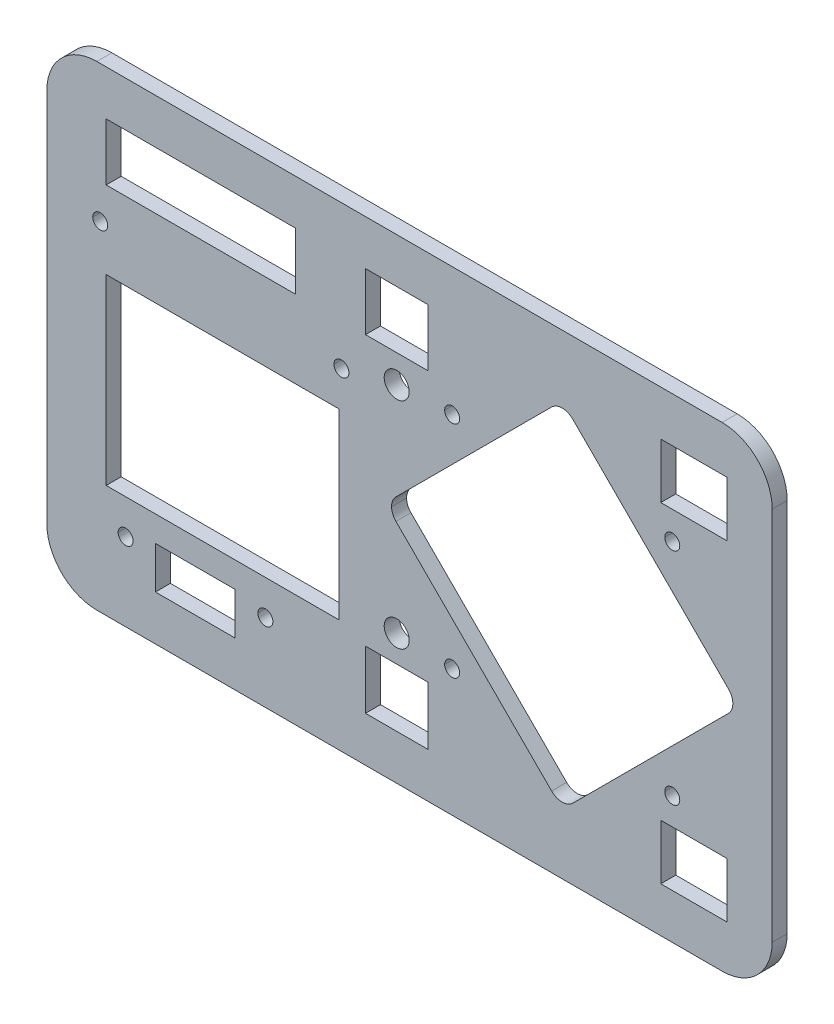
ISO-10303-21;
HEADER;
FILE_DESCRIPTION(('STEP AP214'),'2;1');
FILE_NAME('part.step','',(''),(''),'','','');
FILE_SCHEMA(('AUTOMOTIVE_DESIGN { 1 0 10303 214 1 1 1 1 }'));
ENDSEC;
DATA;
#1=APPLICATION_CONTEXT('core data for automotive mechanical design processes');
#2=APPLICATION_PROTOCOL_DEFINITION('international standard','automotive_design',2000,#1);
#3=PRODUCT_CONTEXT('',#1,'mechanical');
#4=PRODUCT('Part','Part','',(#3));
#5=PRODUCT_RELATED_PRODUCT_CATEGORY('part','',(#4));
#6=PRODUCT_DEFINITION_FORMATION('','',#4);
#7=PRODUCT_DEFINITION_CONTEXT('part definition',#1,'design');
#8=PRODUCT_DEFINITION('design','',#6,#7);
#9=PRODUCT_DEFINITION_SHAPE('','',#8);
#10=(LENGTH_UNIT() NAMED_UNIT(*) SI_UNIT(.MILLI.,.METRE.));
#11=(NAMED_UNIT(*) PLANE_ANGLE_UNIT() SI_UNIT($,.RADIAN.));
#12=(NAMED_UNIT(*) SI_UNIT($,.STERADIAN.) SOLID_ANGLE_UNIT());
#13=UNCERTAINTY_MEASURE_WITH_UNIT(LENGTH_MEASURE(1.E-05),#10,'distance_accuracy_value','');
#14=(GEOMETRIC_REPRESENTATION_CONTEXT(3) GLOBAL_UNCERTAINTY_ASSIGNED_CONTEXT((#13)) GLOBAL_UNIT_ASSIGNED_CONTEXT((#10,
#11,#12)) REPRESENTATION_CONTEXT('',''));
#15=CARTESIAN_POINT('',(0.,0.,0.));
#16=DIRECTION('',(0.,0.,1.));
#17=DIRECTION('',(1.,0.,0.));
#18=AXIS2_PLACEMENT_3D('',#15,#16,#17);
#19=CARTESIAN_POINT('',(210.81212736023,-100.397544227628,3.));
#20=DIRECTION('',(0.,0.,-1.));
#21=DIRECTION('',(-1.,0.,0.));
#22=AXIS2_PLACEMENT_3D('',#19,#20,#21);
#23=PLANE('',#22);
#24=CARTESIAN_POINT('',(145.757899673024,-41.4,3.));
#25=DIRECTION('',(0.,0.,1.));
#26=DIRECTION('',(1.,0.,0.));
#27=AXIS2_PLACEMENT_3D('',#24,#25,#26);
#28=CIRCLE('',#27,2.5);
#29=CARTESIAN_POINT('',(148.257899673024,-41.4,3.));
#30=VERTEX_POINT('',#29);
#31=EDGE_CURVE('E443',#30,#30,#28,.T.);
#32=ORIENTED_EDGE('',*,*,#31,.F.);
#33=EDGE_LOOP('',(#32));
#34=FACE_BOUND('',#33,.T.);
#35=DIRECTION('',(0.,1.,0.));
#36=VECTOR('',#35,1.);
#37=CARTESIAN_POINT('',(125.513280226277,-24.4,3.));
#38=LINE('',#37,#36);
#39=CARTESIAN_POINT('',(125.513280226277,-35.8416509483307,3.));
#40=VERTEX_POINT('',#39);
#41=CARTESIAN_POINT('',(125.513280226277,-24.4,3.));
#42=VERTEX_POINT('',#41);
#43=EDGE_CURVE('E453',#40,#42,#38,.T.);
#44=ORIENTED_EDGE('',*,*,#43,.F.);
#45=DIRECTION('',(1.,0.,0.));
#46=VECTOR('',#45,1.);
#47=CARTESIAN_POINT('',(125.513280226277,-35.8416509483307,3.));
#48=LINE('',#47,#46);
#49=CARTESIAN_POINT('',(87.6728700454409,-35.8416509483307,3.));
#50=VERTEX_POINT('',#49);
#51=EDGE_CURVE('E461',#50,#40,#48,.T.);
#52=ORIENTED_EDGE('',*,*,#51,.F.);
#53=DIRECTION('',(0.,-1.,0.));
#54=VECTOR('',#53,1.);
#55=CARTESIAN_POINT('',(87.6728700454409,-24.4,3.));
#56=LINE('',#55,#54);
#57=CARTESIAN_POINT('',(87.6728700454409,-24.4,3.));
#58=VERTEX_POINT('',#57);
#59=EDGE_CURVE('E458',#58,#50,#56,.T.);
#60=ORIENTED_EDGE('',*,*,#59,.F.);
#61=DIRECTION('',(-1.,0.,0.));
#62=VECTOR('',#61,1.);
#63=CARTESIAN_POINT('',(125.513280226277,-24.4,3.));
#64=LINE('',#63,#62);
#65=EDGE_CURVE('E455',#42,#58,#64,.T.);
#66=ORIENTED_EDGE('',*,*,#65,.F.);
#67=EDGE_LOOP('',(#44,#52,#60,#66));
#68=FACE_BOUND('',#67,.T.);
#69=DIRECTION('',(0.,-1.,0.));
#70=VECTOR('',#69,1.);
#71=CARTESIAN_POINT('',(139.514231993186,-24.4,3.));
#72=LINE('',#71,#70);
#73=CARTESIAN_POINT('',(139.514231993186,-24.4,3.));
#74=VERTEX_POINT('',#73);
#75=CARTESIAN_POINT('',(139.514231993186,-35.8416509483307,3.));
#76=VERTEX_POINT('',#75);
#77=EDGE_CURVE('E515',#74,#76,#72,.T.);
#78=ORIENTED_EDGE('',*,*,#77,.F.);
#79=DIRECTION('',(-1.,0.,0.));
#80=VECTOR('',#79,1.);
#81=CARTESIAN_POINT('',(139.514231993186,-24.4,3.));
#82=LINE('',#81,#80);
#83=CARTESIAN_POINT('',(152.001567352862,-24.4,3.));
#84=VERTEX_POINT('',#83);
#85=EDGE_CURVE('E523',#84,#74,#82,.T.);
#86=ORIENTED_EDGE('',*,*,#85,.F.);
#87=DIRECTION('',(0.,1.,0.));
#88=VECTOR('',#87,1.);
#89=CARTESIAN_POINT('',(152.001567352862,-24.4,3.));
#90=LINE('',#89,#88);
#91=CARTESIAN_POINT('',(152.001567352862,-35.8416509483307,3.));
#92=VERTEX_POINT('',#91);
#93=EDGE_CURVE('E520',#92,#84,#90,.T.);
#94=ORIENTED_EDGE('',*,*,#93,.F.);
#95=DIRECTION('',(1.,0.,0.));
#96=VECTOR('',#95,1.);
#97=CARTESIAN_POINT('',(139.514231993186,-35.8416509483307,3.));
#98=LINE('',#97,#96);
#99=EDGE_CURVE('E517',#76,#92,#98,.T.);
#100=ORIENTED_EDGE('',*,*,#99,.F.);
#101=EDGE_LOOP('',(#78,#86,#94,#100));
#102=FACE_BOUND('',#101,.T.);
#103=DIRECTION('',(0.,1.,0.));
#104=VECTOR('',#103,1.);
#105=CARTESIAN_POINT('',(211.81,-101.4,3.));
#106=LINE('',#105,#104);
#107=CARTESIAN_POINT('',(211.81,-101.4,3.));
#108=VERTEX_POINT('',#107);
#109=CARTESIAN_POINT('',(211.81,-90.4,3.));
#110=VERTEX_POINT('',#109);
#111=EDGE_CURVE('E577',#108,#110,#106,.T.);
#112=ORIENTED_EDGE('',*,*,#111,.F.);
#113=DIRECTION('',(1.,0.,0.));
#114=VECTOR('',#113,1.);
#115=CARTESIAN_POINT('',(211.81,-101.4,3.));
#116=LINE('',#115,#114);
#117=CARTESIAN_POINT('',(198.54527187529,-101.4,3.));
#118=VERTEX_POINT('',#117);
#119=EDGE_CURVE('E585',#118,#108,#116,.T.);
#120=ORIENTED_EDGE('',*,*,#119,.F.);
#121=DIRECTION('',(0.,-1.,0.));
#122=VECTOR('',#121,1.);
#123=CARTESIAN_POINT('',(198.54527187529,-101.4,3.));
#124=LINE('',#123,#122);
#125=CARTESIAN_POINT('',(198.54527187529,-90.4,3.));
#126=VERTEX_POINT('',#125);
#127=EDGE_CURVE('E582',#126,#118,#124,.T.);
#128=ORIENTED_EDGE('',*,*,#127,.F.);
#129=DIRECTION('',(-1.,0.,0.));
#130=VECTOR('',#129,1.);
#131=CARTESIAN_POINT('',(211.81,-90.4,3.));
#132=LINE('',#131,#130);
#133=EDGE_CURVE('E579',#110,#126,#132,.T.);
#134=ORIENTED_EDGE('',*,*,#133,.F.);
#135=EDGE_LOOP('',(#112,#120,#128,#134));
#136=FACE_BOUND('',#135,.T.);
#137=CARTESIAN_POINT('',(119.499920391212,-94.8142449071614,3.));
#138=DIRECTION('',(0.,0.,-1.));
#139=DIRECTION('',(-1.,0.,0.));
#140=AXIS2_PLACEMENT_3D('',#137,#138,#139);
#141=CIRCLE('',#140,1.5);
#142=CARTESIAN_POINT('',(117.999920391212,-94.8142449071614,3.));
#143=VERTEX_POINT('',#142);
#144=CARTESIAN_POINT('',(120.999920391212,-94.8142449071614,3.));
#145=VERTEX_POINT('',#144);
#146=EDGE_CURVE('E783',#143,#145,#141,.T.);
#147=ORIENTED_EDGE('',*,*,#146,.T.);
#148=CARTESIAN_POINT('',(119.499920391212,-94.8142449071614,3.));
#149=DIRECTION('',(0.,0.,-1.));
#150=DIRECTION('',(-1.,0.,0.));
#151=AXIS2_PLACEMENT_3D('',#148,#149,#150);
#152=CIRCLE('',#151,1.5);
#153=EDGE_CURVE('E33',#145,#143,#152,.T.);
#154=ORIENTED_EDGE('',*,*,#153,.T.);
#155=EDGE_LOOP('',(#147,#154));
#156=FACE_BOUND('',#155,.T.);
#157=CARTESIAN_POINT('',(86.4844395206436,-42.7442449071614,3.));
#158=DIRECTION('',(0.,0.,-1.));
#159=DIRECTION('',(-1.,0.,0.));
#160=AXIS2_PLACEMENT_3D('',#157,#158,#159);
#161=CIRCLE('',#160,1.5);
#162=CARTESIAN_POINT('',(84.9844395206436,-42.7442449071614,3.));
#163=VERTEX_POINT('',#162);
#164=CARTESIAN_POINT('',(87.9844395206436,-42.7442449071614,3.));
#165=VERTEX_POINT('',#164);
#166=EDGE_CURVE('E776',#163,#165,#161,.T.);
#167=ORIENTED_EDGE('',*,*,#166,.T.);
#168=CARTESIAN_POINT('',(86.4844395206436,-42.7442449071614,3.));
#169=DIRECTION('',(0.,0.,-1.));
#170=DIRECTION('',(-1.,0.,0.));
#171=AXIS2_PLACEMENT_3D('',#168,#169,#170);
#172=CIRCLE('',#171,1.5);
#173=EDGE_CURVE('E780',#165,#163,#172,.T.);
#174=ORIENTED_EDGE('',*,*,#173,.T.);
#175=EDGE_LOOP('',(#167,#174));
#176=FACE_BOUND('',#175,.T.);
#177=CARTESIAN_POINT('',(200.841254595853,-85.0080740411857,3.));
#178=DIRECTION('',(0.,0.,-1.));
#179=DIRECTION('',(-1.,0.,0.));
#180=AXIS2_PLACEMENT_3D('',#177,#178,#179);
#181=CIRCLE('',#180,1.4999999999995);
#182=CARTESIAN_POINT('',(199.341254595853,-85.0080740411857,3.));
#183=VERTEX_POINT('',#182);
#184=CARTESIAN_POINT('',(202.341254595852,-85.0080740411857,3.));
#185=VERTEX_POINT('',#184);
#186=EDGE_CURVE('E769',#183,#185,#181,.T.);
#187=ORIENTED_EDGE('',*,*,#186,.T.);
#188=CARTESIAN_POINT('',(200.841254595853,-85.0080740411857,3.));
#189=DIRECTION('',(0.,0.,-1.));
#190=DIRECTION('',(-1.,0.,0.));
#191=AXIS2_PLACEMENT_3D('',#188,#189,#190);
#192=CIRCLE('',#191,1.4999999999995);
#193=EDGE_CURVE('E773',#185,#183,#192,.T.);
#194=ORIENTED_EDGE('',*,*,#193,.T.);
#195=EDGE_LOOP('',(#187,#194));
#196=FACE_BOUND('',#195,.T.);
#197=CARTESIAN_POINT('',(156.837999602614,-41.004819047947,3.));
#198=DIRECTION('',(0.,0.,-1.));
#199=DIRECTION('',(-1.,0.,0.));
#200=AXIS2_PLACEMENT_3D('',#197,#198,#199);
#201=CIRCLE('',#200,1.49999999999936);
#202=CARTESIAN_POINT('',(155.337999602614,-41.004819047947,3.));
#203=VERTEX_POINT('',#202);
#204=CARTESIAN_POINT('',(158.337999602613,-41.004819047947,3.));
#205=VERTEX_POINT('',#204);
#206=EDGE_CURVE('E762',#203,#205,#201,.T.);
#207=ORIENTED_EDGE('',*,*,#206,.T.);
#208=CARTESIAN_POINT('',(156.837999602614,-41.004819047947,3.));
#209=DIRECTION('',(0.,0.,-1.));
#210=DIRECTION('',(-1.,0.,0.));
#211=AXIS2_PLACEMENT_3D('',#208,#209,#210);
#212=CIRCLE('',#211,1.49999999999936);
#213=EDGE_CURVE('E766',#205,#203,#212,.T.);
#214=ORIENTED_EDGE('',*,*,#213,.T.);
#215=EDGE_LOOP('',(#207,#214));
#216=FACE_BOUND('',#215,.T.);
#217=DIRECTION('',(0.,-1.,0.));
#218=VECTOR('',#217,1.);
#219=CARTESIAN_POINT('',(220.81212736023,-25.3975442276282,3.));
#220=LINE('',#219,#218);
#221=CARTESIAN_POINT('',(220.81212736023,-100.397544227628,3.));
#222=VERTEX_POINT('',#221);
#223=CARTESIAN_POINT('',(220.81212736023,-25.3975442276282,3.));
#224=VERTEX_POINT('',#223);
#225=EDGE_CURVE('E734',#222,#224,#220,.F.);
#226=ORIENTED_EDGE('',*,*,#225,.T.);
#227=CARTESIAN_POINT('',(210.81212736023,-25.3975442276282,3.));
#228=DIRECTION('',(0.,0.,-1.));
#229=DIRECTION('',(-1.,0.,0.));
#230=AXIS2_PLACEMENT_3D('',#227,#228,#229);
#231=CIRCLE('',#230,10.);
#232=CARTESIAN_POINT('',(210.81212736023,-15.3975442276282,3.));
#233=VERTEX_POINT('',#232);
#234=EDGE_CURVE('E738',#233,#224,#231,.T.);
#235=ORIENTED_EDGE('',*,*,#234,.F.);
#236=DIRECTION('',(1.,0.,0.));
#237=VECTOR('',#236,1.);
#238=CARTESIAN_POINT('',(210.81212736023,-15.3975442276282,3.));
#239=LINE('',#238,#237);
#240=CARTESIAN_POINT('',(85.8121273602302,-15.3975442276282,3.));
#241=VERTEX_POINT('',#240);
#242=EDGE_CURVE('E744',#233,#241,#239,.F.);
#243=ORIENTED_EDGE('',*,*,#242,.T.);
#244=CARTESIAN_POINT('',(85.8121273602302,-25.3975442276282,3.));
#245=DIRECTION('',(0.,0.,-1.));
#246=DIRECTION('',(-1.,0.,0.));
#247=AXIS2_PLACEMENT_3D('',#244,#245,#246);
#248=CIRCLE('',#247,10.);
#249=CARTESIAN_POINT('',(75.8121273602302,-25.3975442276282,3.));
#250=VERTEX_POINT('',#249);
#251=EDGE_CURVE('E748',#250,#241,#248,.T.);
#252=ORIENTED_EDGE('',*,*,#251,.F.);
#253=DIRECTION('',(0.,1.,0.));
#254=VECTOR('',#253,1.);
#255=CARTESIAN_POINT('',(75.8121273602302,-25.3975442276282,3.));
#256=LINE('',#255,#254);
#257=CARTESIAN_POINT('',(75.8121273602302,-100.397544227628,3.));
#258=VERTEX_POINT('',#257);
#259=EDGE_CURVE('E751',#250,#258,#256,.F.);
#260=ORIENTED_EDGE('',*,*,#259,.T.);
#261=CARTESIAN_POINT('',(85.8121273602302,-100.397544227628,3.));
#262=DIRECTION('',(0.,0.,-1.));
#263=DIRECTION('',(-1.,0.,0.));
#264=AXIS2_PLACEMENT_3D('',#261,#262,#263);
#265=CIRCLE('',#264,9.99999999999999);
#266=CARTESIAN_POINT('',(85.8121273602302,-110.397544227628,3.));
#267=VERTEX_POINT('',#266);
#268=EDGE_CURVE('E755',#267,#258,#265,.T.);
#269=ORIENTED_EDGE('',*,*,#268,.F.);
#270=DIRECTION('',(-1.,0.,0.));
#271=VECTOR('',#270,1.);
#272=CARTESIAN_POINT('',(210.81212736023,-110.397544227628,3.));
#273=LINE('',#272,#271);
#274=CARTESIAN_POINT('',(210.81212736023,-110.397544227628,3.));
#275=VERTEX_POINT('',#274);
#276=EDGE_CURVE('E758',#267,#275,#273,.F.);
#277=ORIENTED_EDGE('',*,*,#276,.T.);
#278=CARTESIAN_POINT('',(210.81212736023,-100.397544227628,3.));
#279=DIRECTION('',(0.,0.,-1.));
#280=DIRECTION('',(-1.,0.,0.));
#281=AXIS2_PLACEMENT_3D('',#278,#279,#280);
#282=CIRCLE('',#281,9.99999999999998);
#283=EDGE_CURVE('E761',#222,#275,#282,.T.);
#284=ORIENTED_EDGE('',*,*,#283,.F.);
#285=EDGE_LOOP('',(#226,#235,#243,#252,#260,#269,#277,#284));
#286=FACE_BOUND('',#285,.T.);
#287=CARTESIAN_POINT('',(156.837999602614,-85.0080740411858,3.));
#288=DIRECTION('',(0.,0.,-1.));
#289=DIRECTION('',(-1.,0.,0.));
#290=AXIS2_PLACEMENT_3D('',#287,#288,#289);
#291=CIRCLE('',#290,1.49999999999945);
#292=CARTESIAN_POINT('',(155.337999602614,-85.0080740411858,3.));
#293=VERTEX_POINT('',#292);
#294=CARTESIAN_POINT('',(158.337999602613,-85.0080740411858,3.));
#295=VERTEX_POINT('',#294);
#296=EDGE_CURVE('E727',#293,#295,#291,.T.);
#297=ORIENTED_EDGE('',*,*,#296,.T.);
#298=CARTESIAN_POINT('',(156.837999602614,-85.0080740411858,3.));
#299=DIRECTION('',(0.,0.,-1.));
#300=DIRECTION('',(-1.,0.,0.));
#301=AXIS2_PLACEMENT_3D('',#298,#299,#300);
#302=CIRCLE('',#301,1.49999999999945);
#303=EDGE_CURVE('E731',#295,#293,#302,.T.);
#304=ORIENTED_EDGE('',*,*,#303,.T.);
#305=EDGE_LOOP('',(#297,#304));
#306=FACE_BOUND('',#305,.T.);
#307=CARTESIAN_POINT('',(200.841254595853,-41.0048190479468,3.));
#308=DIRECTION('',(0.,0.,-1.));
#309=DIRECTION('',(-1.,0.,0.));
#310=AXIS2_PLACEMENT_3D('',#307,#308,#309);
#311=CIRCLE('',#310,1.49999999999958);
#312=CARTESIAN_POINT('',(199.341254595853,-41.0048190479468,3.));
#313=VERTEX_POINT('',#312);
#314=CARTESIAN_POINT('',(202.341254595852,-41.0048190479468,3.));
#315=VERTEX_POINT('',#314);
#316=EDGE_CURVE('E720',#313,#315,#311,.T.);
#317=ORIENTED_EDGE('',*,*,#316,.T.);
#318=CARTESIAN_POINT('',(200.841254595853,-41.0048190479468,3.));
#319=DIRECTION('',(0.,0.,-1.));
#320=DIRECTION('',(-1.,0.,0.));
#321=AXIS2_PLACEMENT_3D('',#318,#319,#320);
#322=CIRCLE('',#321,1.49999999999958);
#323=EDGE_CURVE('E724',#315,#313,#322,.T.);
#324=ORIENTED_EDGE('',*,*,#323,.T.);
#325=EDGE_LOOP('',(#317,#324));
#326=FACE_BOUND('',#325,.T.);
#327=DIRECTION('',(-0.70710678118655,0.707106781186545,0.));
#328=VECTOR('',#327,1.);
#329=CARTESIAN_POINT('',(176.718306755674,-96.240465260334,3.));
#330=LINE('',#329,#328);
#331=CARTESIAN_POINT('',(145.605608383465,-65.127766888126,3.));
#332=VERTEX_POINT('',#331);
#333=CARTESIAN_POINT('',(176.718306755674,-96.240465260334,3.));
#334=VERTEX_POINT('',#333);
#335=EDGE_CURVE('E719',#332,#334,#330,.F.);
#336=ORIENTED_EDGE('',*,*,#335,.F.);
#337=CARTESIAN_POINT('',(147.726928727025,-63.0064465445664,3.));
#338=DIRECTION('',(0.,0.,-1.));
#339=DIRECTION('',(-1.,0.,0.));
#340=AXIS2_PLACEMENT_3D('',#337,#338,#339);
#341=CIRCLE('',#340,3.);
#342=CARTESIAN_POINT('',(144.726928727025,-63.0064465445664,3.));
#343=VERTEX_POINT('',#342);
#344=EDGE_CURVE('E689',#332,#343,#341,.T.);
#345=ORIENTED_EDGE('',*,*,#344,.T.);
#346=CARTESIAN_POINT('',(147.726928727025,-63.0064465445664,3.));
#347=DIRECTION('',(0.,0.,-1.));
#348=DIRECTION('',(-1.,0.,0.));
#349=AXIS2_PLACEMENT_3D('',#346,#347,#348);
#350=CIRCLE('',#349,3.);
#351=CARTESIAN_POINT('',(145.605608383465,-60.8851262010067,3.));
#352=VERTEX_POINT('',#351);
#353=EDGE_CURVE('E693',#343,#352,#350,.T.);
#354=ORIENTED_EDGE('',*,*,#353,.T.);
#355=DIRECTION('',(0.707106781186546,0.707106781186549,0.));
#356=VECTOR('',#355,1.);
#357=CARTESIAN_POINT('',(145.605608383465,-60.8851262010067,3.));
#358=LINE('',#357,#356);
#359=CARTESIAN_POINT('',(176.718306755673,-29.7724278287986,3.));
#360=VERTEX_POINT('',#359);
#361=EDGE_CURVE('E696',#360,#352,#358,.F.);
#362=ORIENTED_EDGE('',*,*,#361,.F.);
#363=CARTESIAN_POINT('',(178.839627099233,-31.8937481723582,3.));
#364=DIRECTION('',(0.,0.,-1.));
#365=DIRECTION('',(-1.,0.,0.));
#366=AXIS2_PLACEMENT_3D('',#363,#364,#365);
#367=CIRCLE('',#366,3.);
#368=CARTESIAN_POINT('',(180.960947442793,-29.7724278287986,3.));
#369=VERTEX_POINT('',#368);
#370=EDGE_CURVE('E702',#360,#369,#367,.T.);
#371=ORIENTED_EDGE('',*,*,#370,.T.);
#372=DIRECTION('',(0.707106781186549,-0.707106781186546,0.));
#373=VECTOR('',#372,1.);
#374=CARTESIAN_POINT('',(180.960947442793,-29.7724278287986,3.));
#375=LINE('',#374,#373);
#376=CARTESIAN_POINT('',(212.073645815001,-60.8851262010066,3.));
#377=VERTEX_POINT('',#376);
#378=EDGE_CURVE('E706',#377,#369,#375,.F.);
#379=ORIENTED_EDGE('',*,*,#378,.F.);
#380=CARTESIAN_POINT('',(209.952325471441,-63.0064465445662,3.));
#381=DIRECTION('',(0.,0.,-1.));
#382=DIRECTION('',(-1.,0.,0.));
#383=AXIS2_PLACEMENT_3D('',#380,#381,#382);
#384=CIRCLE('',#383,3.);
#385=CARTESIAN_POINT('',(212.073645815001,-65.1277668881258,3.));
#386=VERTEX_POINT('',#385);
#387=EDGE_CURVE('E709',#377,#386,#384,.T.);
#388=ORIENTED_EDGE('',*,*,#387,.T.);
#389=DIRECTION('',(-0.707106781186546,-0.70710678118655,0.));
#390=VECTOR('',#389,1.);
#391=CARTESIAN_POINT('',(212.073645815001,-65.1277668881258,3.));
#392=LINE('',#391,#390);
#393=CARTESIAN_POINT('',(180.960947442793,-96.240465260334,3.));
#394=VERTEX_POINT('',#393);
#395=EDGE_CURVE('E713',#394,#386,#392,.F.);
#396=ORIENTED_EDGE('',*,*,#395,.F.);
#397=CARTESIAN_POINT('',(178.839627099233,-94.1191449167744,3.));
#398=DIRECTION('',(0.,0.,-1.));
#399=DIRECTION('',(-1.,0.,0.));
#400=AXIS2_PLACEMENT_3D('',#397,#398,#399);
#401=CIRCLE('',#400,3.);
#402=EDGE_CURVE('E716',#394,#334,#401,.T.);
#403=ORIENTED_EDGE('',*,*,#402,.T.);
#404=EDGE_LOOP('',(#336,#345,#354,#362,#371,#379,#388,#396,#403));
#405=FACE_BOUND('',#404,.T.);
#406=CARTESIAN_POINT('',(134.704025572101,-44.1136206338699,3.));
#407=DIRECTION('',(0.,0.,-1.));
#408=DIRECTION('',(-1.,0.,0.));
#409=AXIS2_PLACEMENT_3D('',#406,#407,#408);
#410=CIRCLE('',#409,1.5);
#411=CARTESIAN_POINT('',(133.204025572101,-44.1136206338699,3.));
#412=VERTEX_POINT('',#411);
#413=CARTESIAN_POINT('',(136.204025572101,-44.1136206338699,3.));
#414=VERTEX_POINT('',#413);
#415=EDGE_CURVE('E682',#412,#414,#410,.T.);
#416=ORIENTED_EDGE('',*,*,#415,.T.);
#417=CARTESIAN_POINT('',(134.704025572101,-44.1136206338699,3.));
#418=DIRECTION('',(0.,0.,-1.));
#419=DIRECTION('',(-1.,0.,0.));
#420=AXIS2_PLACEMENT_3D('',#417,#418,#419);
#421=CIRCLE('',#420,1.5);
#422=EDGE_CURVE('E686',#414,#412,#421,.T.);
#423=ORIENTED_EDGE('',*,*,#422,.T.);
#424=EDGE_LOOP('',(#416,#423));
#425=FACE_BOUND('',#424,.T.);
#426=CARTESIAN_POINT('',(91.5644395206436,-94.8142449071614,3.));
#427=DIRECTION('',(0.,0.,-1.));
#428=DIRECTION('',(-1.,0.,0.));
#429=AXIS2_PLACEMENT_3D('',#426,#427,#428);
#430=CIRCLE('',#429,1.5);
#431=CARTESIAN_POINT('',(90.0644395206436,-94.8142449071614,3.));
#432=VERTEX_POINT('',#431);
#433=CARTESIAN_POINT('',(93.0644395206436,-94.8142449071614,3.));
#434=VERTEX_POINT('',#433);
#435=EDGE_CURVE('E675',#432,#434,#430,.T.);
#436=ORIENTED_EDGE('',*,*,#435,.T.);
#437=CARTESIAN_POINT('',(91.5644395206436,-94.8142449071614,3.));
#438=DIRECTION('',(0.,0.,-1.));
#439=DIRECTION('',(-1.,0.,0.));
#440=AXIS2_PLACEMENT_3D('',#437,#438,#439);
#441=CIRCLE('',#440,1.5);
#442=EDGE_CURVE('E679',#434,#432,#441,.T.);
#443=ORIENTED_EDGE('',*,*,#442,.T.);
#444=EDGE_LOOP('',(#436,#443));
#445=FACE_BOUND('',#444,.T.);
#446=DIRECTION('',(0.,1.,0.));
#447=VECTOR('',#446,1.);
#448=CARTESIAN_POINT('',(211.81,-24.4,3.));
#449=LINE('',#448,#447);
#450=CARTESIAN_POINT('',(211.81,-35.4,3.));
#451=VERTEX_POINT('',#450);
#452=CARTESIAN_POINT('',(211.81,-24.4,3.));
#453=VERTEX_POINT('',#452);
#454=EDGE_CURVE('E608',#451,#453,#449,.T.);
#455=ORIENTED_EDGE('',*,*,#454,.F.);
#456=DIRECTION('',(1.,0.,0.));
#457=VECTOR('',#456,1.);
#458=CARTESIAN_POINT('',(211.81,-35.4,3.));
#459=LINE('',#458,#457);
#460=CARTESIAN_POINT('',(198.54527187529,-35.4,3.));
#461=VERTEX_POINT('',#460);
#462=EDGE_CURVE('E616',#461,#451,#459,.T.);
#463=ORIENTED_EDGE('',*,*,#462,.F.);
#464=DIRECTION('',(0.,-1.,0.));
#465=VECTOR('',#464,1.);
#466=CARTESIAN_POINT('',(198.54527187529,-24.4,3.));
#467=LINE('',#466,#465);
#468=CARTESIAN_POINT('',(198.54527187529,-24.4,3.));
#469=VERTEX_POINT('',#468);
#470=EDGE_CURVE('E613',#469,#461,#467,.T.);
#471=ORIENTED_EDGE('',*,*,#470,.F.);
#472=DIRECTION('',(-1.,0.,0.));
#473=VECTOR('',#472,1.);
#474=CARTESIAN_POINT('',(211.81,-24.4,3.));
#475=LINE('',#474,#473);
#476=EDGE_CURVE('E610',#453,#469,#475,.T.);
#477=ORIENTED_EDGE('',*,*,#476,.F.);
#478=EDGE_LOOP('',(#455,#463,#471,#477));
#479=FACE_BOUND('',#478,.T.);
#480=DIRECTION('',(0.,-1.,0.));
#481=VECTOR('',#480,1.);
#482=CARTESIAN_POINT('',(139.514231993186,-101.4,3.));
#483=LINE('',#482,#481);
#484=CARTESIAN_POINT('',(139.514231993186,-89.7642354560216,3.));
#485=VERTEX_POINT('',#484);
#486=CARTESIAN_POINT('',(139.514231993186,-101.4,3.));
#487=VERTEX_POINT('',#486);
#488=EDGE_CURVE('E546',#485,#487,#483,.T.);
#489=ORIENTED_EDGE('',*,*,#488,.F.);
#490=DIRECTION('',(-1.,0.,0.));
#491=VECTOR('',#490,1.);
#492=CARTESIAN_POINT('',(139.514231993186,-89.7642354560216,3.));
#493=LINE('',#492,#491);
#494=CARTESIAN_POINT('',(152.001567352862,-89.7642354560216,3.));
#495=VERTEX_POINT('',#494);
#496=EDGE_CURVE('E554',#495,#485,#493,.T.);
#497=ORIENTED_EDGE('',*,*,#496,.F.);
#498=DIRECTION('',(0.,1.,0.));
#499=VECTOR('',#498,1.);
#500=CARTESIAN_POINT('',(152.001567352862,-101.4,3.));
#501=LINE('',#500,#499);
#502=CARTESIAN_POINT('',(152.001567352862,-101.4,3.));
#503=VERTEX_POINT('',#502);
#504=EDGE_CURVE('E551',#503,#495,#501,.T.);
#505=ORIENTED_EDGE('',*,*,#504,.F.);
#506=DIRECTION('',(1.,0.,0.));
#507=VECTOR('',#506,1.);
#508=CARTESIAN_POINT('',(139.514231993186,-101.4,3.));
#509=LINE('',#508,#507);
#510=EDGE_CURVE('E548',#487,#503,#509,.T.);
#511=ORIENTED_EDGE('',*,*,#510,.F.);
#512=EDGE_LOOP('',(#489,#497,#505,#511));
#513=FACE_BOUND('',#512,.T.);
#514=DIRECTION('',(0.,1.,0.));
#515=VECTOR('',#514,1.);
#516=CARTESIAN_POINT('',(134.216574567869,-51.3562191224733,3.));
#517=LINE('',#516,#515);
#518=CARTESIAN_POINT('',(134.216574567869,-87.8722149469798,3.));
#519=VERTEX_POINT('',#518);
#520=CARTESIAN_POINT('',(134.216574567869,-51.3562191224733,3.));
#521=VERTEX_POINT('',#520);
#522=EDGE_CURVE('E484',#519,#521,#517,.T.);
#523=ORIENTED_EDGE('',*,*,#522,.F.);
#524=DIRECTION('',(1.,0.,0.));
#525=VECTOR('',#524,1.);
#526=CARTESIAN_POINT('',(134.216574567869,-87.8722149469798,3.));
#527=LINE('',#526,#525);
#528=CARTESIAN_POINT('',(87.6728700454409,-87.8722149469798,3.));
#529=VERTEX_POINT('',#528);
#530=EDGE_CURVE('E492',#529,#519,#527,.T.);
#531=ORIENTED_EDGE('',*,*,#530,.F.);
#532=DIRECTION('',(0.,-1.,0.));
#533=VECTOR('',#532,1.);
#534=CARTESIAN_POINT('',(87.6728700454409,-51.3562191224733,3.));
#535=LINE('',#534,#533);
#536=CARTESIAN_POINT('',(87.6728700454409,-51.3562191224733,3.));
#537=VERTEX_POINT('',#536);
#538=EDGE_CURVE('E489',#537,#529,#535,.T.);
#539=ORIENTED_EDGE('',*,*,#538,.F.);
#540=DIRECTION('',(-1.,0.,0.));
#541=VECTOR('',#540,1.);
#542=CARTESIAN_POINT('',(134.216574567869,-51.3562191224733,3.));
#543=LINE('',#542,#541);
#544=EDGE_CURVE('E486',#521,#537,#543,.T.);
#545=ORIENTED_EDGE('',*,*,#544,.F.);
#546=EDGE_LOOP('',(#523,#531,#539,#545));
#547=FACE_BOUND('',#546,.T.);
#548=DIRECTION('',(0.,-1.,0.));
#549=VECTOR('',#548,1.);
#550=CARTESIAN_POINT('',(97.5113766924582,-92.9806703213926,3.));
#551=LINE('',#550,#549);
#552=CARTESIAN_POINT('',(97.5113766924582,-92.9806703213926,3.));
#553=VERTEX_POINT('',#552);
#554=CARTESIAN_POINT('',(97.5113766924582,-101.4,3.));
#555=VERTEX_POINT('',#554);
#556=EDGE_CURVE('E414',#553,#555,#551,.T.);
#557=ORIENTED_EDGE('',*,*,#556,.F.);
#558=DIRECTION('',(-1.,0.,0.));
#559=VECTOR('',#558,1.);
#560=CARTESIAN_POINT('',(97.5113766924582,-92.9806703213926,3.));
#561=LINE('',#560,#559);
#562=CARTESIAN_POINT('',(113.404348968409,-92.9806703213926,3.));
#563=VERTEX_POINT('',#562);
#564=EDGE_CURVE('E437',#563,#553,#561,.T.);
#565=ORIENTED_EDGE('',*,*,#564,.F.);
#566=DIRECTION('',(0.,1.,0.));
#567=VECTOR('',#566,1.);
#568=CARTESIAN_POINT('',(113.404348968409,-92.9806703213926,3.));
#569=LINE('',#568,#567);
#570=CARTESIAN_POINT('',(113.404348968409,-101.4,3.));
#571=VERTEX_POINT('',#570);
#572=EDGE_CURVE('E435',#571,#563,#569,.T.);
#573=ORIENTED_EDGE('',*,*,#572,.F.);
#574=DIRECTION('',(1.,0.,0.));
#575=VECTOR('',#574,1.);
#576=CARTESIAN_POINT('',(97.5113766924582,-101.4,3.));
#577=LINE('',#576,#575);
#578=EDGE_CURVE('E422',#555,#571,#577,.T.);
#579=ORIENTED_EDGE('',*,*,#578,.F.);
#580=EDGE_LOOP('',(#557,#565,#573,#579));
#581=FACE_BOUND('',#580,.T.);
#582=CARTESIAN_POINT('',(145.757899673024,-84.4,3.));
#583=DIRECTION('',(0.,0.,1.));
#584=DIRECTION('',(1.,0.,0.));
#585=AXIS2_PLACEMENT_3D('',#582,#583,#584);
#586=CIRCLE('',#585,2.5);
#587=CARTESIAN_POINT('',(148.257899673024,-84.4,3.));
#588=VERTEX_POINT('',#587);
#589=EDGE_CURVE('E925',#588,#588,#586,.T.);
#590=ORIENTED_EDGE('',*,*,#589,.F.);
#591=EDGE_LOOP('',(#590));
#592=FACE_BOUND('',#591,.T.);
#593=ADVANCED_FACE('F30',(#34,#68,#102,#136,#156,#176,#196,#216,#286,#306,#326,#405,#425,#445,
#479,#513,#547,#581,#592),#23,.F.);
#594=CARTESIAN_POINT('',(210.81212736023,-100.397544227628,0.));
#595=DIRECTION('',(0.,0.,-1.));
#596=DIRECTION('',(-1.,0.,0.));
#597=AXIS2_PLACEMENT_3D('',#594,#595,#596);
#598=PLANE('',#597);
#599=CARTESIAN_POINT('',(145.757899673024,-41.4,0.));
#600=DIRECTION('',(0.,0.,1.));
#601=DIRECTION('',(1.,0.,0.));
#602=AXIS2_PLACEMENT_3D('',#599,#600,#601);
#603=CIRCLE('',#602,2.5);
#604=CARTESIAN_POINT('',(148.257899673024,-41.4,0.));
#605=VERTEX_POINT('',#604);
#606=EDGE_CURVE('E928',#605,#605,#603,.T.);
#607=ORIENTED_EDGE('',*,*,#606,.T.);
#608=EDGE_LOOP('',(#607));
#609=FACE_BOUND('',#608,.T.);
#610=DIRECTION('',(1.,0.,0.));
#611=VECTOR('',#610,1.);
#612=CARTESIAN_POINT('',(125.513280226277,-35.8416509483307,0.));
#613=LINE('',#612,#611);
#614=CARTESIAN_POINT('',(87.6728700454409,-35.8416509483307,0.));
#615=VERTEX_POINT('',#614);
#616=CARTESIAN_POINT('',(125.513280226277,-35.8416509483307,0.));
#617=VERTEX_POINT('',#616);
#618=EDGE_CURVE('E456',#615,#617,#613,.T.);
#619=ORIENTED_EDGE('',*,*,#618,.T.);
#620=DIRECTION('',(0.,1.,0.));
#621=VECTOR('',#620,1.);
#622=CARTESIAN_POINT('',(125.513280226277,-24.4,0.));
#623=LINE('',#622,#621);
#624=CARTESIAN_POINT('',(125.513280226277,-24.4,0.));
#625=VERTEX_POINT('',#624);
#626=EDGE_CURVE('E430',#617,#625,#623,.T.);
#627=ORIENTED_EDGE('',*,*,#626,.T.);
#628=DIRECTION('',(-1.,0.,0.));
#629=VECTOR('',#628,1.);
#630=CARTESIAN_POINT('',(125.513280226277,-24.4,0.));
#631=LINE('',#630,#629);
#632=CARTESIAN_POINT('',(87.6728700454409,-24.4,0.));
#633=VERTEX_POINT('',#632);
#634=EDGE_CURVE('E466',#625,#633,#631,.T.);
#635=ORIENTED_EDGE('',*,*,#634,.T.);
#636=DIRECTION('',(0.,-1.,0.));
#637=VECTOR('',#636,1.);
#638=CARTESIAN_POINT('',(87.6728700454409,-24.4,0.));
#639=LINE('',#638,#637);
#640=EDGE_CURVE('E469',#633,#615,#639,.T.);
#641=ORIENTED_EDGE('',*,*,#640,.T.);
#642=EDGE_LOOP('',(#619,#627,#635,#641));
#643=FACE_BOUND('',#642,.T.);
#644=DIRECTION('',(-1.,0.,0.));
#645=VECTOR('',#644,1.);
#646=CARTESIAN_POINT('',(139.514231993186,-24.4,0.));
#647=LINE('',#646,#645);
#648=CARTESIAN_POINT('',(152.001567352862,-24.4,0.));
#649=VERTEX_POINT('',#648);
#650=CARTESIAN_POINT('',(139.514231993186,-24.4,0.));
#651=VERTEX_POINT('',#650);
#652=EDGE_CURVE('E518',#649,#651,#647,.T.);
#653=ORIENTED_EDGE('',*,*,#652,.T.);
#654=DIRECTION('',(0.,-1.,0.));
#655=VECTOR('',#654,1.);
#656=CARTESIAN_POINT('',(139.514231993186,-24.4,0.));
#657=LINE('',#656,#655);
#658=CARTESIAN_POINT('',(139.514231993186,-35.8416509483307,0.));
#659=VERTEX_POINT('',#658);
#660=EDGE_CURVE('E514',#651,#659,#657,.T.);
#661=ORIENTED_EDGE('',*,*,#660,.T.);
#662=DIRECTION('',(1.,0.,0.));
#663=VECTOR('',#662,1.);
#664=CARTESIAN_POINT('',(139.514231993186,-35.8416509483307,0.));
#665=LINE('',#664,#663);
#666=CARTESIAN_POINT('',(152.001567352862,-35.8416509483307,0.));
#667=VERTEX_POINT('',#666);
#668=EDGE_CURVE('E528',#659,#667,#665,.T.);
#669=ORIENTED_EDGE('',*,*,#668,.T.);
#670=DIRECTION('',(0.,1.,0.));
#671=VECTOR('',#670,1.);
#672=CARTESIAN_POINT('',(152.001567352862,-24.4,0.));
#673=LINE('',#672,#671);
#674=EDGE_CURVE('E531',#667,#649,#673,.T.);
#675=ORIENTED_EDGE('',*,*,#674,.T.);
#676=EDGE_LOOP('',(#653,#661,#669,#675));
#677=FACE_BOUND('',#676,.T.);
#678=DIRECTION('',(1.,0.,0.));
#679=VECTOR('',#678,1.);
#680=CARTESIAN_POINT('',(211.81,-101.4,0.));
#681=LINE('',#680,#679);
#682=CARTESIAN_POINT('',(198.54527187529,-101.4,0.));
#683=VERTEX_POINT('',#682);
#684=CARTESIAN_POINT('',(211.81,-101.4,0.));
#685=VERTEX_POINT('',#684);
#686=EDGE_CURVE('E580',#683,#685,#681,.T.);
#687=ORIENTED_EDGE('',*,*,#686,.T.);
#688=DIRECTION('',(0.,1.,0.));
#689=VECTOR('',#688,1.);
#690=CARTESIAN_POINT('',(211.81,-101.4,0.));
#691=LINE('',#690,#689);
#692=CARTESIAN_POINT('',(211.81,-90.4,0.));
#693=VERTEX_POINT('',#692);
#694=EDGE_CURVE('E576',#685,#693,#691,.T.);
#695=ORIENTED_EDGE('',*,*,#694,.T.);
#696=DIRECTION('',(-1.,0.,0.));
#697=VECTOR('',#696,1.);
#698=CARTESIAN_POINT('',(211.81,-90.4,0.));
#699=LINE('',#698,#697);
#700=CARTESIAN_POINT('',(198.54527187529,-90.4,0.));
#701=VERTEX_POINT('',#700);
#702=EDGE_CURVE('E590',#693,#701,#699,.T.);
#703=ORIENTED_EDGE('',*,*,#702,.T.);
#704=DIRECTION('',(0.,-1.,0.));
#705=VECTOR('',#704,1.);
#706=CARTESIAN_POINT('',(198.54527187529,-101.4,0.));
#707=LINE('',#706,#705);
#708=EDGE_CURVE('E593',#701,#683,#707,.T.);
#709=ORIENTED_EDGE('',*,*,#708,.T.);
#710=EDGE_LOOP('',(#687,#695,#703,#709));
#711=FACE_BOUND('',#710,.T.);
#712=CARTESIAN_POINT('',(119.499920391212,-94.8142449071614,0.));
#713=DIRECTION('',(0.,0.,-1.));
#714=DIRECTION('',(-1.,0.,0.));
#715=AXIS2_PLACEMENT_3D('',#712,#713,#714);
#716=CIRCLE('',#715,1.5);
#717=CARTESIAN_POINT('',(117.999920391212,-94.8142449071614,0.));
#718=VERTEX_POINT('',#717);
#719=CARTESIAN_POINT('',(120.999920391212,-94.8142449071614,0.));
#720=VERTEX_POINT('',#719);
#721=EDGE_CURVE('E674',#718,#720,#716,.F.);
#722=ORIENTED_EDGE('',*,*,#721,.T.);
#723=CARTESIAN_POINT('',(119.499920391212,-94.8142449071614,0.));
#724=DIRECTION('',(0.,0.,-1.));
#725=DIRECTION('',(-1.,0.,0.));
#726=AXIS2_PLACEMENT_3D('',#723,#724,#725);
#727=CIRCLE('',#726,1.5);
#728=EDGE_CURVE('E853',#720,#718,#727,.F.);
#729=ORIENTED_EDGE('',*,*,#728,.T.);
#730=EDGE_LOOP('',(#722,#729));
#731=FACE_BOUND('',#730,.T.);
#732=CARTESIAN_POINT('',(86.4844395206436,-42.7442449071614,0.));
#733=DIRECTION('',(0.,0.,-1.));
#734=DIRECTION('',(-1.,0.,0.));
#735=AXIS2_PLACEMENT_3D('',#732,#733,#734);
#736=CIRCLE('',#735,1.5);
#737=CARTESIAN_POINT('',(84.9844395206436,-42.7442449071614,0.));
#738=VERTEX_POINT('',#737);
#739=CARTESIAN_POINT('',(87.9844395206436,-42.7442449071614,0.));
#740=VERTEX_POINT('',#739);
#741=EDGE_CURVE('E850',#738,#740,#736,.F.);
#742=ORIENTED_EDGE('',*,*,#741,.T.);
#743=CARTESIAN_POINT('',(86.4844395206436,-42.7442449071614,0.));
#744=DIRECTION('',(0.,0.,-1.));
#745=DIRECTION('',(-1.,0.,0.));
#746=AXIS2_PLACEMENT_3D('',#743,#744,#745);
#747=CIRCLE('',#746,1.5);
#748=EDGE_CURVE('E847',#740,#738,#747,.F.);
#749=ORIENTED_EDGE('',*,*,#748,.T.);
#750=EDGE_LOOP('',(#742,#749));
#751=FACE_BOUND('',#750,.T.);
#752=CARTESIAN_POINT('',(200.841254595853,-85.0080740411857,0.));
#753=DIRECTION('',(0.,0.,-1.));
#754=DIRECTION('',(-1.,0.,0.));
#755=AXIS2_PLACEMENT_3D('',#752,#753,#754);
#756=CIRCLE('',#755,1.4999999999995);
#757=CARTESIAN_POINT('',(199.341254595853,-85.0080740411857,0.));
#758=VERTEX_POINT('',#757);
#759=CARTESIAN_POINT('',(202.341254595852,-85.0080740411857,0.));
#760=VERTEX_POINT('',#759);
#761=EDGE_CURVE('E844',#758,#760,#756,.F.);
#762=ORIENTED_EDGE('',*,*,#761,.T.);
#763=CARTESIAN_POINT('',(200.841254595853,-85.0080740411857,0.));
#764=DIRECTION('',(0.,0.,-1.));
#765=DIRECTION('',(-1.,0.,0.));
#766=AXIS2_PLACEMENT_3D('',#763,#764,#765);
#767=CIRCLE('',#766,1.4999999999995);
#768=EDGE_CURVE('E841',#760,#758,#767,.F.);
#769=ORIENTED_EDGE('',*,*,#768,.T.);
#770=EDGE_LOOP('',(#762,#769));
#771=FACE_BOUND('',#770,.T.);
#772=CARTESIAN_POINT('',(156.837999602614,-41.004819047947,0.));
#773=DIRECTION('',(0.,0.,-1.));
#774=DIRECTION('',(-1.,0.,0.));
#775=AXIS2_PLACEMENT_3D('',#772,#773,#774);
#776=CIRCLE('',#775,1.49999999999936);
#777=CARTESIAN_POINT('',(155.337999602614,-41.004819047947,0.));
#778=VERTEX_POINT('',#777);
#779=CARTESIAN_POINT('',(158.337999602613,-41.004819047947,0.));
#780=VERTEX_POINT('',#779);
#781=EDGE_CURVE('E838',#778,#780,#776,.F.);
#782=ORIENTED_EDGE('',*,*,#781,.T.);
#783=CARTESIAN_POINT('',(156.837999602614,-41.004819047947,0.));
#784=DIRECTION('',(0.,0.,-1.));
#785=DIRECTION('',(-1.,0.,0.));
#786=AXIS2_PLACEMENT_3D('',#783,#784,#785);
#787=CIRCLE('',#786,1.49999999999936);
#788=EDGE_CURVE('E835',#780,#778,#787,.F.);
#789=ORIENTED_EDGE('',*,*,#788,.T.);
#790=EDGE_LOOP('',(#782,#789));
#791=FACE_BOUND('',#790,.T.);
#792=CARTESIAN_POINT('',(210.81212736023,-25.3975442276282,0.));
#793=DIRECTION('',(0.,0.,-1.));
#794=DIRECTION('',(-1.,0.,0.));
#795=AXIS2_PLACEMENT_3D('',#792,#793,#794);
#796=CIRCLE('',#795,10.);
#797=CARTESIAN_POINT('',(210.81212736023,-15.3975442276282,0.));
#798=VERTEX_POINT('',#797);
#799=CARTESIAN_POINT('',(220.81212736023,-25.3975442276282,0.));
#800=VERTEX_POINT('',#799);
#801=EDGE_CURVE('E659',#798,#800,#796,.T.);
#802=ORIENTED_EDGE('',*,*,#801,.T.);
#803=DIRECTION('',(0.,1.,0.));
#804=VECTOR('',#803,1.);
#805=CARTESIAN_POINT('',(220.81212736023,-100.397544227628,0.));
#806=LINE('',#805,#804);
#807=CARTESIAN_POINT('',(220.81212736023,-100.397544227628,0.));
#808=VERTEX_POINT('',#807);
#809=EDGE_CURVE('E655',#800,#808,#806,.F.);
#810=ORIENTED_EDGE('',*,*,#809,.T.);
#811=CARTESIAN_POINT('',(210.81212736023,-100.397544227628,0.));
#812=DIRECTION('',(0.,0.,-1.));
#813=DIRECTION('',(-1.,0.,0.));
#814=AXIS2_PLACEMENT_3D('',#811,#812,#813);
#815=CIRCLE('',#814,9.99999999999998);
#816=CARTESIAN_POINT('',(210.81212736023,-110.397544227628,0.));
#817=VERTEX_POINT('',#816);
#818=EDGE_CURVE('E671',#808,#817,#815,.T.);
#819=ORIENTED_EDGE('',*,*,#818,.T.);
#820=DIRECTION('',(-1.,0.,0.));
#821=VECTOR('',#820,1.);
#822=CARTESIAN_POINT('',(210.81212736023,-110.397544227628,0.));
#823=LINE('',#822,#821);
#824=CARTESIAN_POINT('',(85.8121273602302,-110.397544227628,0.));
#825=VERTEX_POINT('',#824);
#826=EDGE_CURVE('E668',#817,#825,#823,.T.);
#827=ORIENTED_EDGE('',*,*,#826,.T.);
#828=CARTESIAN_POINT('',(85.8121273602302,-100.397544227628,0.));
#829=DIRECTION('',(0.,0.,-1.));
#830=DIRECTION('',(-1.,0.,0.));
#831=AXIS2_PLACEMENT_3D('',#828,#829,#830);
#832=CIRCLE('',#831,9.99999999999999);
#833=CARTESIAN_POINT('',(75.8121273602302,-100.397544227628,0.));
#834=VERTEX_POINT('',#833);
#835=EDGE_CURVE('E667',#825,#834,#832,.T.);
#836=ORIENTED_EDGE('',*,*,#835,.T.);
#837=DIRECTION('',(0.,1.,0.));
#838=VECTOR('',#837,1.);
#839=CARTESIAN_POINT('',(75.8121273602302,-100.397544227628,0.));
#840=LINE('',#839,#838);
#841=CARTESIAN_POINT('',(75.8121273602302,-25.3975442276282,0.));
#842=VERTEX_POINT('',#841);
#843=EDGE_CURVE('E664',#834,#842,#840,.T.);
#844=ORIENTED_EDGE('',*,*,#843,.T.);
#845=CARTESIAN_POINT('',(85.8121273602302,-25.3975442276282,0.));
#846=DIRECTION('',(0.,0.,-1.));
#847=DIRECTION('',(-1.,0.,0.));
#848=AXIS2_PLACEMENT_3D('',#845,#846,#847);
#849=CIRCLE('',#848,10.);
#850=CARTESIAN_POINT('',(85.8121273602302,-15.3975442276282,0.));
#851=VERTEX_POINT('',#850);
#852=EDGE_CURVE('E663',#842,#851,#849,.T.);
#853=ORIENTED_EDGE('',*,*,#852,.T.);
#854=DIRECTION('',(-1.,0.,0.));
#855=VECTOR('',#854,1.);
#856=CARTESIAN_POINT('',(210.81212736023,-15.3975442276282,0.));
#857=LINE('',#856,#855);
#858=EDGE_CURVE('E660',#851,#798,#857,.F.);
#859=ORIENTED_EDGE('',*,*,#858,.T.);
#860=EDGE_LOOP('',(#802,#810,#819,#827,#836,#844,#853,#859));
#861=FACE_BOUND('',#860,.T.);
#862=CARTESIAN_POINT('',(156.837999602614,-85.0080740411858,0.));
#863=DIRECTION('',(0.,0.,-1.));
#864=DIRECTION('',(-1.,0.,0.));
#865=AXIS2_PLACEMENT_3D('',#862,#863,#864);
#866=CIRCLE('',#865,1.49999999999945);
#867=CARTESIAN_POINT('',(155.337999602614,-85.0080740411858,0.));
#868=VERTEX_POINT('',#867);
#869=CARTESIAN_POINT('',(158.337999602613,-85.0080740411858,0.));
#870=VERTEX_POINT('',#869);
#871=EDGE_CURVE('E658',#868,#870,#866,.F.);
#872=ORIENTED_EDGE('',*,*,#871,.T.);
#873=CARTESIAN_POINT('',(156.837999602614,-85.0080740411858,0.));
#874=DIRECTION('',(0.,0.,-1.));
#875=DIRECTION('',(-1.,0.,0.));
#876=AXIS2_PLACEMENT_3D('',#873,#874,#875);
#877=CIRCLE('',#876,1.49999999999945);
#878=EDGE_CURVE('E822',#870,#868,#877,.F.);
#879=ORIENTED_EDGE('',*,*,#878,.T.);
#880=EDGE_LOOP('',(#872,#879));
#881=FACE_BOUND('',#880,.T.);
#882=CARTESIAN_POINT('',(200.841254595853,-41.0048190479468,0.));
#883=DIRECTION('',(0.,0.,-1.));
#884=DIRECTION('',(-1.,0.,0.));
#885=AXIS2_PLACEMENT_3D('',#882,#883,#884);
#886=CIRCLE('',#885,1.49999999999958);
#887=CARTESIAN_POINT('',(199.341254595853,-41.0048190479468,0.));
#888=VERTEX_POINT('',#887);
#889=CARTESIAN_POINT('',(202.341254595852,-41.0048190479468,0.));
#890=VERTEX_POINT('',#889);
#891=EDGE_CURVE('E819',#888,#890,#886,.F.);
#892=ORIENTED_EDGE('',*,*,#891,.T.);
#893=CARTESIAN_POINT('',(200.841254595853,-41.0048190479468,0.));
#894=DIRECTION('',(0.,0.,-1.));
#895=DIRECTION('',(-1.,0.,0.));
#896=AXIS2_PLACEMENT_3D('',#893,#894,#895);
#897=CIRCLE('',#896,1.49999999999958);
#898=EDGE_CURVE('E654',#890,#888,#897,.F.);
#899=ORIENTED_EDGE('',*,*,#898,.T.);
#900=EDGE_LOOP('',(#892,#899));
#901=FACE_BOUND('',#900,.T.);
#902=CARTESIAN_POINT('',(147.726928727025,-63.0064465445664,0.));
#903=DIRECTION('',(0.,0.,-1.));
#904=DIRECTION('',(-1.,0.,0.));
#905=AXIS2_PLACEMENT_3D('',#902,#903,#904);
#906=CIRCLE('',#905,3.);
#907=CARTESIAN_POINT('',(145.605608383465,-60.8851262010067,0.));
#908=VERTEX_POINT('',#907);
#909=CARTESIAN_POINT('',(144.726928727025,-63.0064465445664,0.));
#910=VERTEX_POINT('',#909);
#911=EDGE_CURVE('E641',#908,#910,#906,.F.);
#912=ORIENTED_EDGE('',*,*,#911,.T.);
#913=CARTESIAN_POINT('',(147.726928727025,-63.0064465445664,0.));
#914=DIRECTION('',(0.,0.,-1.));
#915=DIRECTION('',(-1.,0.,0.));
#916=AXIS2_PLACEMENT_3D('',#913,#914,#915);
#917=CIRCLE('',#916,3.);
#918=CARTESIAN_POINT('',(145.605608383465,-65.127766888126,0.));
#919=VERTEX_POINT('',#918);
#920=EDGE_CURVE('E806',#910,#919,#917,.F.);
#921=ORIENTED_EDGE('',*,*,#920,.T.);
#922=DIRECTION('',(0.70710678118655,-0.707106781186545,0.));
#923=VECTOR('',#922,1.);
#924=CARTESIAN_POINT('',(145.605608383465,-65.127766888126,0.));
#925=LINE('',#924,#923);
#926=CARTESIAN_POINT('',(176.718306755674,-96.240465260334,0.));
#927=VERTEX_POINT('',#926);
#928=EDGE_CURVE('E651',#919,#927,#925,.T.);
#929=ORIENTED_EDGE('',*,*,#928,.T.);
#930=CARTESIAN_POINT('',(178.839627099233,-94.1191449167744,0.));
#931=DIRECTION('',(0.,0.,-1.));
#932=DIRECTION('',(-1.,0.,0.));
#933=AXIS2_PLACEMENT_3D('',#930,#931,#932);
#934=CIRCLE('',#933,3.);
#935=CARTESIAN_POINT('',(180.960947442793,-96.240465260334,0.));
#936=VERTEX_POINT('',#935);
#937=EDGE_CURVE('E650',#927,#936,#934,.F.);
#938=ORIENTED_EDGE('',*,*,#937,.T.);
#939=DIRECTION('',(0.707106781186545,0.70710678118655,0.));
#940=VECTOR('',#939,1.);
#941=CARTESIAN_POINT('',(180.960947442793,-96.240465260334,0.));
#942=LINE('',#941,#940);
#943=CARTESIAN_POINT('',(212.073645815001,-65.1277668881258,0.));
#944=VERTEX_POINT('',#943);
#945=EDGE_CURVE('E647',#936,#944,#942,.T.);
#946=ORIENTED_EDGE('',*,*,#945,.T.);
#947=CARTESIAN_POINT('',(209.952325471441,-63.0064465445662,0.));
#948=DIRECTION('',(0.,0.,-1.));
#949=DIRECTION('',(-1.,0.,0.));
#950=AXIS2_PLACEMENT_3D('',#947,#948,#949);
#951=CIRCLE('',#950,3.);
#952=CARTESIAN_POINT('',(212.073645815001,-60.8851262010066,0.));
#953=VERTEX_POINT('',#952);
#954=EDGE_CURVE('E646',#944,#953,#951,.F.);
#955=ORIENTED_EDGE('',*,*,#954,.T.);
#956=DIRECTION('',(-0.707106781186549,0.707106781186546,0.));
#957=VECTOR('',#956,1.);
#958=CARTESIAN_POINT('',(212.073645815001,-60.8851262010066,0.));
#959=LINE('',#958,#957);
#960=CARTESIAN_POINT('',(180.960947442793,-29.7724278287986,0.));
#961=VERTEX_POINT('',#960);
#962=EDGE_CURVE('E643',#953,#961,#959,.T.);
#963=ORIENTED_EDGE('',*,*,#962,.T.);
#964=CARTESIAN_POINT('',(178.839627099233,-31.8937481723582,0.));
#965=DIRECTION('',(0.,0.,-1.));
#966=DIRECTION('',(-1.,0.,0.));
#967=AXIS2_PLACEMENT_3D('',#964,#965,#966);
#968=CIRCLE('',#967,3.);
#969=CARTESIAN_POINT('',(176.718306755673,-29.7724278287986,0.));
#970=VERTEX_POINT('',#969);
#971=EDGE_CURVE('E642',#961,#970,#968,.F.);
#972=ORIENTED_EDGE('',*,*,#971,.T.);
#973=DIRECTION('',(-0.707106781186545,-0.70710678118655,0.));
#974=VECTOR('',#973,1.);
#975=CARTESIAN_POINT('',(176.718306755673,-29.7724278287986,0.));
#976=LINE('',#975,#974);
#977=EDGE_CURVE('E638',#970,#908,#976,.T.);
#978=ORIENTED_EDGE('',*,*,#977,.T.);
#979=EDGE_LOOP('',(#912,#921,#929,#938,#946,#955,#963,#972,#978));
#980=FACE_BOUND('',#979,.T.);
#981=CARTESIAN_POINT('',(134.704025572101,-44.1136206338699,0.));
#982=DIRECTION('',(0.,0.,-1.));
#983=DIRECTION('',(-1.,0.,0.));
#984=AXIS2_PLACEMENT_3D('',#981,#982,#983);
#985=CIRCLE('',#984,1.5);
#986=CARTESIAN_POINT('',(133.204025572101,-44.1136206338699,0.));
#987=VERTEX_POINT('',#986);
#988=CARTESIAN_POINT('',(136.204025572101,-44.1136206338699,0.));
#989=VERTEX_POINT('',#988);
#990=EDGE_CURVE('E803',#987,#989,#985,.F.);
#991=ORIENTED_EDGE('',*,*,#990,.T.);
#992=CARTESIAN_POINT('',(134.704025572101,-44.1136206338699,0.));
#993=DIRECTION('',(0.,0.,-1.));
#994=DIRECTION('',(-1.,0.,0.));
#995=AXIS2_PLACEMENT_3D('',#992,#993,#994);
#996=CIRCLE('',#995,1.5);
#997=EDGE_CURVE('E800',#989,#987,#996,.F.);
#998=ORIENTED_EDGE('',*,*,#997,.T.);
#999=EDGE_LOOP('',(#991,#998));
#1000=FACE_BOUND('',#999,.T.);
#1001=CARTESIAN_POINT('',(91.5644395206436,-94.8142449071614,0.));
#1002=DIRECTION('',(0.,0.,-1.));
#1003=DIRECTION('',(-1.,0.,0.));
#1004=AXIS2_PLACEMENT_3D('',#1001,#1002,#1003);
#1005=CIRCLE('',#1004,1.5);
#1006=CARTESIAN_POINT('',(90.0644395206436,-94.8142449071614,0.));
#1007=VERTEX_POINT('',#1006);
#1008=CARTESIAN_POINT('',(93.0644395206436,-94.8142449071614,0.));
#1009=VERTEX_POINT('',#1008);
#1010=EDGE_CURVE('E38',#1007,#1009,#1005,.F.);
#1011=ORIENTED_EDGE('',*,*,#1010,.T.);
#1012=CARTESIAN_POINT('',(91.5644395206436,-94.8142449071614,0.));
#1013=DIRECTION('',(0.,0.,-1.));
#1014=DIRECTION('',(-1.,0.,0.));
#1015=AXIS2_PLACEMENT_3D('',#1012,#1013,#1014);
#1016=CIRCLE('',#1015,1.5);
#1017=EDGE_CURVE('E11',#1009,#1007,#1016,.F.);
#1018=ORIENTED_EDGE('',*,*,#1017,.T.);
#1019=EDGE_LOOP('',(#1011,#1018));
#1020=FACE_BOUND('',#1019,.T.);
#1021=DIRECTION('',(1.,0.,0.));
#1022=VECTOR('',#1021,1.);
#1023=CARTESIAN_POINT('',(211.81,-35.4,0.));
#1024=LINE('',#1023,#1022);
#1025=CARTESIAN_POINT('',(198.54527187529,-35.4,0.));
#1026=VERTEX_POINT('',#1025);
#1027=CARTESIAN_POINT('',(211.81,-35.4,0.));
#1028=VERTEX_POINT('',#1027);
#1029=EDGE_CURVE('E611',#1026,#1028,#1024,.T.);
#1030=ORIENTED_EDGE('',*,*,#1029,.T.);
#1031=DIRECTION('',(0.,1.,0.));
#1032=VECTOR('',#1031,1.);
#1033=CARTESIAN_POINT('',(211.81,-24.4,0.));
#1034=LINE('',#1033,#1032);
#1035=CARTESIAN_POINT('',(211.81,-24.4,0.));
#1036=VERTEX_POINT('',#1035);
#1037=EDGE_CURVE('E607',#1028,#1036,#1034,.T.);
#1038=ORIENTED_EDGE('',*,*,#1037,.T.);
#1039=DIRECTION('',(-1.,0.,0.));
#1040=VECTOR('',#1039,1.);
#1041=CARTESIAN_POINT('',(211.81,-24.4,0.));
#1042=LINE('',#1041,#1040);
#1043=CARTESIAN_POINT('',(198.54527187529,-24.4,0.));
#1044=VERTEX_POINT('',#1043);
#1045=EDGE_CURVE('E621',#1036,#1044,#1042,.T.);
#1046=ORIENTED_EDGE('',*,*,#1045,.T.);
#1047=DIRECTION('',(0.,-1.,0.));
#1048=VECTOR('',#1047,1.);
#1049=CARTESIAN_POINT('',(198.54527187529,-24.4,0.));
#1050=LINE('',#1049,#1048);
#1051=EDGE_CURVE('E624',#1044,#1026,#1050,.T.);
#1052=ORIENTED_EDGE('',*,*,#1051,.T.);
#1053=EDGE_LOOP('',(#1030,#1038,#1046,#1052));
#1054=FACE_BOUND('',#1053,.T.);
#1055=DIRECTION('',(-1.,0.,0.));
#1056=VECTOR('',#1055,1.);
#1057=CARTESIAN_POINT('',(139.514231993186,-89.7642354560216,0.));
#1058=LINE('',#1057,#1056);
#1059=CARTESIAN_POINT('',(152.001567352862,-89.7642354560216,0.));
#1060=VERTEX_POINT('',#1059);
#1061=CARTESIAN_POINT('',(139.514231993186,-89.7642354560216,0.));
#1062=VERTEX_POINT('',#1061);
#1063=EDGE_CURVE('E549',#1060,#1062,#1058,.T.);
#1064=ORIENTED_EDGE('',*,*,#1063,.T.);
#1065=DIRECTION('',(0.,-1.,0.));
#1066=VECTOR('',#1065,1.);
#1067=CARTESIAN_POINT('',(139.514231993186,-101.4,0.));
#1068=LINE('',#1067,#1066);
#1069=CARTESIAN_POINT('',(139.514231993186,-101.4,0.));
#1070=VERTEX_POINT('',#1069);
#1071=EDGE_CURVE('E545',#1062,#1070,#1068,.T.);
#1072=ORIENTED_EDGE('',*,*,#1071,.T.);
#1073=DIRECTION('',(1.,0.,0.));
#1074=VECTOR('',#1073,1.);
#1075=CARTESIAN_POINT('',(139.514231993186,-101.4,0.));
#1076=LINE('',#1075,#1074);
#1077=CARTESIAN_POINT('',(152.001567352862,-101.4,0.));
#1078=VERTEX_POINT('',#1077);
#1079=EDGE_CURVE('E559',#1070,#1078,#1076,.T.);
#1080=ORIENTED_EDGE('',*,*,#1079,.T.);
#1081=DIRECTION('',(0.,1.,0.));
#1082=VECTOR('',#1081,1.);
#1083=CARTESIAN_POINT('',(152.001567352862,-101.4,0.));
#1084=LINE('',#1083,#1082);
#1085=EDGE_CURVE('E562',#1078,#1060,#1084,.T.);
#1086=ORIENTED_EDGE('',*,*,#1085,.T.);
#1087=EDGE_LOOP('',(#1064,#1072,#1080,#1086));
#1088=FACE_BOUND('',#1087,.T.);
#1089=DIRECTION('',(1.,0.,0.));
#1090=VECTOR('',#1089,1.);
#1091=CARTESIAN_POINT('',(134.216574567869,-87.8722149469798,0.));
#1092=LINE('',#1091,#1090);
#1093=CARTESIAN_POINT('',(87.6728700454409,-87.8722149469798,0.));
#1094=VERTEX_POINT('',#1093);
#1095=CARTESIAN_POINT('',(134.216574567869,-87.8722149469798,0.));
#1096=VERTEX_POINT('',#1095);
#1097=EDGE_CURVE('E487',#1094,#1096,#1092,.T.);
#1098=ORIENTED_EDGE('',*,*,#1097,.T.);
#1099=DIRECTION('',(0.,1.,0.));
#1100=VECTOR('',#1099,1.);
#1101=CARTESIAN_POINT('',(134.216574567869,-51.3562191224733,0.));
#1102=LINE('',#1101,#1100);
#1103=CARTESIAN_POINT('',(134.216574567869,-51.3562191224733,0.));
#1104=VERTEX_POINT('',#1103);
#1105=EDGE_CURVE('E483',#1096,#1104,#1102,.T.);
#1106=ORIENTED_EDGE('',*,*,#1105,.T.);
#1107=DIRECTION('',(-1.,0.,0.));
#1108=VECTOR('',#1107,1.);
#1109=CARTESIAN_POINT('',(134.216574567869,-51.3562191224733,0.));
#1110=LINE('',#1109,#1108);
#1111=CARTESIAN_POINT('',(87.6728700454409,-51.3562191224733,0.));
#1112=VERTEX_POINT('',#1111);
#1113=EDGE_CURVE('E497',#1104,#1112,#1110,.T.);
#1114=ORIENTED_EDGE('',*,*,#1113,.T.);
#1115=DIRECTION('',(0.,-1.,0.));
#1116=VECTOR('',#1115,1.);
#1117=CARTESIAN_POINT('',(87.6728700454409,-51.3562191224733,0.));
#1118=LINE('',#1117,#1116);
#1119=EDGE_CURVE('E500',#1112,#1094,#1118,.T.);
#1120=ORIENTED_EDGE('',*,*,#1119,.T.);
#1121=EDGE_LOOP('',(#1098,#1106,#1114,#1120));
#1122=FACE_BOUND('',#1121,.T.);
#1123=DIRECTION('',(-1.,0.,0.));
#1124=VECTOR('',#1123,1.);
#1125=CARTESIAN_POINT('',(97.5113766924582,-92.9806703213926,0.));
#1126=LINE('',#1125,#1124);
#1127=CARTESIAN_POINT('',(113.404348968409,-92.9806703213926,0.));
#1128=VERTEX_POINT('',#1127);
#1129=CARTESIAN_POINT('',(97.5113766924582,-92.9806703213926,0.));
#1130=VERTEX_POINT('',#1129);
#1131=EDGE_CURVE('E423',#1128,#1130,#1126,.T.);
#1132=ORIENTED_EDGE('',*,*,#1131,.T.);
#1133=DIRECTION('',(0.,-1.,0.));
#1134=VECTOR('',#1133,1.);
#1135=CARTESIAN_POINT('',(97.5113766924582,-92.9806703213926,0.));
#1136=LINE('',#1135,#1134);
#1137=CARTESIAN_POINT('',(97.5113766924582,-101.4,0.));
#1138=VERTEX_POINT('',#1137);
#1139=EDGE_CURVE('E54',#1130,#1138,#1136,.T.);
#1140=ORIENTED_EDGE('',*,*,#1139,.T.);
#1141=DIRECTION('',(1.,0.,0.));
#1142=VECTOR('',#1141,1.);
#1143=CARTESIAN_POINT('',(97.5113766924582,-101.4,0.));
#1144=LINE('',#1143,#1142);
#1145=CARTESIAN_POINT('',(113.404348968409,-101.4,0.));
#1146=VERTEX_POINT('',#1145);
#1147=EDGE_CURVE('E429',#1138,#1146,#1144,.T.);
#1148=ORIENTED_EDGE('',*,*,#1147,.T.);
#1149=DIRECTION('',(0.,1.,0.));
#1150=VECTOR('',#1149,1.);
#1151=CARTESIAN_POINT('',(113.404348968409,-92.9806703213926,0.));
#1152=LINE('',#1151,#1150);
#1153=EDGE_CURVE('E445',#1146,#1128,#1152,.T.);
#1154=ORIENTED_EDGE('',*,*,#1153,.T.);
#1155=EDGE_LOOP('',(#1132,#1140,#1148,#1154));
#1156=FACE_BOUND('',#1155,.T.);
#1157=CARTESIAN_POINT('',(145.757899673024,-84.4,0.));
#1158=DIRECTION('',(0.,0.,1.));
#1159=DIRECTION('',(1.,0.,0.));
#1160=AXIS2_PLACEMENT_3D('',#1157,#1158,#1159);
#1161=CIRCLE('',#1160,2.5);
#1162=CARTESIAN_POINT('',(148.257899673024,-84.4,0.));
#1163=VERTEX_POINT('',#1162);
#1164=EDGE_CURVE('E923',#1163,#1163,#1161,.T.);
#1165=ORIENTED_EDGE('',*,*,#1164,.T.);
#1166=EDGE_LOOP('',(#1165));
#1167=FACE_BOUND('',#1166,.T.);
#1168=ADVANCED_FACE('F897',(#609,#643,#677,#711,#731,#751,#771,#791,#861,#881,#901,#980,#1000,
#1020,#1054,#1088,#1122,#1156,#1167),#598,.T.);
#1169=CARTESIAN_POINT('',(119.499920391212,-94.8142449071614,3.));
#1170=DIRECTION('',(0.,0.,-1.));
#1171=DIRECTION('',(-1.,0.,0.));
#1172=AXIS2_PLACEMENT_3D('',#1169,#1170,#1171);
#1173=CYLINDRICAL_SURFACE('',#1172,1.5);
#1174=DIRECTION('',(0.,0.,-1.));
#1175=VECTOR('',#1174,1.);
#1176=CARTESIAN_POINT('',(120.999920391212,-94.8142449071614,3.));
#1177=LINE('',#1176,#1175);
#1178=EDGE_CURVE('E781',#145,#720,#1177,.T.);
#1179=ORIENTED_EDGE('',*,*,#1178,.T.);
#1180=ORIENTED_EDGE('',*,*,#721,.F.);
#1181=DIRECTION('',(0.,0.,-1.));
#1182=VECTOR('',#1181,1.);
#1183=CARTESIAN_POINT('',(117.999920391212,-94.8142449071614,3.));
#1184=LINE('',#1183,#1182);
#1185=EDGE_CURVE('E784',#718,#143,#1184,.F.);
#1186=ORIENTED_EDGE('',*,*,#1185,.T.);
#1187=ORIENTED_EDGE('',*,*,#153,.F.);
#1188=EDGE_LOOP('',(#1179,#1180,#1186,#1187));
#1189=FACE_BOUND('',#1188,.T.);
#1190=ADVANCED_FACE('F893',(#1189),#1173,.F.);
#1191=CARTESIAN_POINT('',(119.499920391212,-94.8142449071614,3.));
#1192=DIRECTION('',(0.,0.,-1.));
#1193=DIRECTION('',(-1.,0.,0.));
#1194=AXIS2_PLACEMENT_3D('',#1191,#1192,#1193);
#1195=CYLINDRICAL_SURFACE('',#1194,1.5);
#1196=ORIENTED_EDGE('',*,*,#146,.F.);
#1197=ORIENTED_EDGE('',*,*,#1185,.F.);
#1198=ORIENTED_EDGE('',*,*,#728,.F.);
#1199=ORIENTED_EDGE('',*,*,#1178,.F.);
#1200=EDGE_LOOP('',(#1196,#1197,#1198,#1199));
#1201=FACE_BOUND('',#1200,.T.);
#1202=ADVANCED_FACE('F895',(#1201),#1195,.F.);
#1203=CARTESIAN_POINT('',(86.4844395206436,-42.7442449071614,3.));
#1204=DIRECTION('',(0.,0.,-1.));
#1205=DIRECTION('',(-1.,0.,0.));
#1206=AXIS2_PLACEMENT_3D('',#1203,#1204,#1205);
#1207=CYLINDRICAL_SURFACE('',#1206,1.5);
#1208=DIRECTION('',(0.,0.,-1.));
#1209=VECTOR('',#1208,1.);
#1210=CARTESIAN_POINT('',(87.9844395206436,-42.7442449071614,3.));
#1211=LINE('',#1210,#1209);
#1212=EDGE_CURVE('E774',#165,#740,#1211,.T.);
#1213=ORIENTED_EDGE('',*,*,#1212,.T.);
#1214=ORIENTED_EDGE('',*,*,#741,.F.);
#1215=DIRECTION('',(0.,0.,-1.));
#1216=VECTOR('',#1215,1.);
#1217=CARTESIAN_POINT('',(84.9844395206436,-42.7442449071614,3.));
#1218=LINE('',#1217,#1216);
#1219=EDGE_CURVE('E777',#738,#163,#1218,.F.);
#1220=ORIENTED_EDGE('',*,*,#1219,.T.);
#1221=ORIENTED_EDGE('',*,*,#173,.F.);
#1222=EDGE_LOOP('',(#1213,#1214,#1220,#1221));
#1223=FACE_BOUND('',#1222,.T.);
#1224=ADVANCED_FACE('F1129',(#1223),#1207,.F.);
#1225=CARTESIAN_POINT('',(86.4844395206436,-42.7442449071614,3.));
#1226=DIRECTION('',(0.,0.,-1.));
#1227=DIRECTION('',(-1.,0.,0.));
#1228=AXIS2_PLACEMENT_3D('',#1225,#1226,#1227);
#1229=CYLINDRICAL_SURFACE('',#1228,1.5);
#1230=ORIENTED_EDGE('',*,*,#166,.F.);
#1231=ORIENTED_EDGE('',*,*,#1219,.F.);
#1232=ORIENTED_EDGE('',*,*,#748,.F.);
#1233=ORIENTED_EDGE('',*,*,#1212,.F.);
#1234=EDGE_LOOP('',(#1230,#1231,#1232,#1233));
#1235=FACE_BOUND('',#1234,.T.);
#1236=ADVANCED_FACE('F1125',(#1235),#1229,.F.);
#1237=CARTESIAN_POINT('',(200.841254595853,-85.0080740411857,3.));
#1238=DIRECTION('',(0.,0.,-1.));
#1239=DIRECTION('',(-1.,0.,0.));
#1240=AXIS2_PLACEMENT_3D('',#1237,#1238,#1239);
#1241=CYLINDRICAL_SURFACE('',#1240,1.4999999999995);
#1242=DIRECTION('',(0.,0.,-1.));
#1243=VECTOR('',#1242,1.);
#1244=CARTESIAN_POINT('',(202.341254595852,-85.0080740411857,3.));
#1245=LINE('',#1244,#1243);
#1246=EDGE_CURVE('E767',#185,#760,#1245,.T.);
#1247=ORIENTED_EDGE('',*,*,#1246,.T.);
#1248=ORIENTED_EDGE('',*,*,#761,.F.);
#1249=DIRECTION('',(0.,0.,-1.));
#1250=VECTOR('',#1249,1.);
#1251=CARTESIAN_POINT('',(199.341254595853,-85.0080740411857,3.));
#1252=LINE('',#1251,#1250);
#1253=EDGE_CURVE('E770',#758,#183,#1252,.F.);
#1254=ORIENTED_EDGE('',*,*,#1253,.T.);
#1255=ORIENTED_EDGE('',*,*,#193,.F.);
#1256=EDGE_LOOP('',(#1247,#1248,#1254,#1255));
#1257=FACE_BOUND('',#1256,.T.);
#1258=ADVANCED_FACE('F1121',(#1257),#1241,.F.);
#1259=CARTESIAN_POINT('',(200.841254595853,-85.0080740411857,3.));
#1260=DIRECTION('',(0.,0.,-1.));
#1261=DIRECTION('',(-1.,0.,0.));
#1262=AXIS2_PLACEMENT_3D('',#1259,#1260,#1261);
#1263=CYLINDRICAL_SURFACE('',#1262,1.4999999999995);
#1264=ORIENTED_EDGE('',*,*,#186,.F.);
#1265=ORIENTED_EDGE('',*,*,#1253,.F.);
#1266=ORIENTED_EDGE('',*,*,#768,.F.);
#1267=ORIENTED_EDGE('',*,*,#1246,.F.);
#1268=EDGE_LOOP('',(#1264,#1265,#1266,#1267));
#1269=FACE_BOUND('',#1268,.T.);
#1270=ADVANCED_FACE('F1117',(#1269),#1263,.F.);
#1271=CARTESIAN_POINT('',(156.837999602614,-41.004819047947,3.));
#1272=DIRECTION('',(0.,0.,-1.));
#1273=DIRECTION('',(-1.,0.,0.));
#1274=AXIS2_PLACEMENT_3D('',#1271,#1272,#1273);
#1275=CYLINDRICAL_SURFACE('',#1274,1.49999999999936);
#1276=DIRECTION('',(0.,0.,-1.));
#1277=VECTOR('',#1276,1.);
#1278=CARTESIAN_POINT('',(158.337999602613,-41.004819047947,3.));
#1279=LINE('',#1278,#1277);
#1280=EDGE_CURVE('E759',#205,#780,#1279,.T.);
#1281=ORIENTED_EDGE('',*,*,#1280,.T.);
#1282=ORIENTED_EDGE('',*,*,#781,.F.);
#1283=DIRECTION('',(0.,0.,-1.));
#1284=VECTOR('',#1283,1.);
#1285=CARTESIAN_POINT('',(155.337999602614,-41.004819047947,3.));
#1286=LINE('',#1285,#1284);
#1287=EDGE_CURVE('E763',#778,#203,#1286,.F.);
#1288=ORIENTED_EDGE('',*,*,#1287,.T.);
#1289=ORIENTED_EDGE('',*,*,#213,.F.);
#1290=EDGE_LOOP('',(#1281,#1282,#1288,#1289));
#1291=FACE_BOUND('',#1290,.T.);
#1292=ADVANCED_FACE('F1113',(#1291),#1275,.F.);
#1293=CARTESIAN_POINT('',(156.837999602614,-41.004819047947,3.));
#1294=DIRECTION('',(0.,0.,-1.));
#1295=DIRECTION('',(-1.,0.,0.));
#1296=AXIS2_PLACEMENT_3D('',#1293,#1294,#1295);
#1297=CYLINDRICAL_SURFACE('',#1296,1.49999999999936);
#1298=ORIENTED_EDGE('',*,*,#206,.F.);
#1299=ORIENTED_EDGE('',*,*,#1287,.F.);
#1300=ORIENTED_EDGE('',*,*,#788,.F.);
#1301=ORIENTED_EDGE('',*,*,#1280,.F.);
#1302=EDGE_LOOP('',(#1298,#1299,#1300,#1301));
#1303=FACE_BOUND('',#1302,.T.);
#1304=ADVANCED_FACE('F1109',(#1303),#1297,.F.);
#1305=CARTESIAN_POINT('',(210.81212736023,-100.397544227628,3.));
#1306=DIRECTION('',(0.,0.,-1.));
#1307=DIRECTION('',(-1.,0.,0.));
#1308=AXIS2_PLACEMENT_3D('',#1305,#1306,#1307);
#1309=CYLINDRICAL_SURFACE('',#1308,9.99999999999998);
#1310=ORIENTED_EDGE('',*,*,#283,.T.);
#1311=DIRECTION('',(0.,0.,1.));
#1312=VECTOR('',#1311,1.);
#1313=CARTESIAN_POINT('',(210.81212736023,-110.397544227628,3.));
#1314=LINE('',#1313,#1312);
#1315=EDGE_CURVE('E756',#275,#817,#1314,.F.);
#1316=ORIENTED_EDGE('',*,*,#1315,.T.);
#1317=ORIENTED_EDGE('',*,*,#818,.F.);
#1318=DIRECTION('',(0.,0.,1.));
#1319=VECTOR('',#1318,1.);
#1320=CARTESIAN_POINT('',(220.81212736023,-100.397544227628,3.));
#1321=LINE('',#1320,#1319);
#1322=EDGE_CURVE('E735',#808,#222,#1321,.T.);
#1323=ORIENTED_EDGE('',*,*,#1322,.T.);
#1324=EDGE_LOOP('',(#1310,#1316,#1317,#1323));
#1325=FACE_BOUND('',#1324,.T.);
#1326=ADVANCED_FACE('F1105',(#1325),#1309,.T.);
#1327=CARTESIAN_POINT('',(210.81212736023,-110.397544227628,3.));
#1328=DIRECTION('',(0.,1.,0.));
#1329=DIRECTION('',(-1.,0.,0.));
#1330=AXIS2_PLACEMENT_3D('',#1327,#1328,#1329);
#1331=PLANE('',#1330);
#1332=ORIENTED_EDGE('',*,*,#1315,.F.);
#1333=ORIENTED_EDGE('',*,*,#276,.F.);
#1334=DIRECTION('',(0.,0.,-1.));
#1335=VECTOR('',#1334,1.);
#1336=CARTESIAN_POINT('',(85.8121273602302,-110.397544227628,3.));
#1337=LINE('',#1336,#1335);
#1338=EDGE_CURVE('E752',#825,#267,#1337,.F.);
#1339=ORIENTED_EDGE('',*,*,#1338,.F.);
#1340=ORIENTED_EDGE('',*,*,#826,.F.);
#1341=EDGE_LOOP('',(#1332,#1333,#1339,#1340));
#1342=FACE_BOUND('',#1341,.T.);
#1343=ADVANCED_FACE('F1101',(#1342),#1331,.F.);
#1344=CARTESIAN_POINT('',(85.8121273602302,-100.397544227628,3.));
#1345=DIRECTION('',(0.,0.,-1.));
#1346=DIRECTION('',(-1.,0.,0.));
#1347=AXIS2_PLACEMENT_3D('',#1344,#1345,#1346);
#1348=CYLINDRICAL_SURFACE('',#1347,9.99999999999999);
#1349=ORIENTED_EDGE('',*,*,#268,.T.);
#1350=DIRECTION('',(0.,0.,-1.));
#1351=VECTOR('',#1350,1.);
#1352=CARTESIAN_POINT('',(75.8121273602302,-100.397544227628,3.));
#1353=LINE('',#1352,#1351);
#1354=EDGE_CURVE('E749',#258,#834,#1353,.T.);
#1355=ORIENTED_EDGE('',*,*,#1354,.T.);
#1356=ORIENTED_EDGE('',*,*,#835,.F.);
#1357=ORIENTED_EDGE('',*,*,#1338,.T.);
#1358=EDGE_LOOP('',(#1349,#1355,#1356,#1357));
#1359=FACE_BOUND('',#1358,.T.);
#1360=ADVANCED_FACE('F1097',(#1359),#1348,.T.);
#1361=CARTESIAN_POINT('',(75.8121273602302,-25.3975442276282,3.));
#1362=DIRECTION('',(1.,0.,0.));
#1363=DIRECTION('',(0.,0.,-1.));
#1364=AXIS2_PLACEMENT_3D('',#1361,#1362,#1363);
#1365=PLANE('',#1364);
#1366=ORIENTED_EDGE('',*,*,#1354,.F.);
#1367=ORIENTED_EDGE('',*,*,#259,.F.);
#1368=DIRECTION('',(0.,0.,-1.));
#1369=VECTOR('',#1368,1.);
#1370=CARTESIAN_POINT('',(75.8121273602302,-25.3975442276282,3.));
#1371=LINE('',#1370,#1369);
#1372=EDGE_CURVE('E745',#842,#250,#1371,.F.);
#1373=ORIENTED_EDGE('',*,*,#1372,.F.);
#1374=ORIENTED_EDGE('',*,*,#843,.F.);
#1375=EDGE_LOOP('',(#1366,#1367,#1373,#1374));
#1376=FACE_BOUND('',#1375,.T.);
#1377=ADVANCED_FACE('F1093',(#1376),#1365,.F.);
#1378=CARTESIAN_POINT('',(85.8121273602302,-25.3975442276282,3.));
#1379=DIRECTION('',(0.,0.,-1.));
#1380=DIRECTION('',(-1.,0.,0.));
#1381=AXIS2_PLACEMENT_3D('',#1378,#1379,#1380);
#1382=CYLINDRICAL_SURFACE('',#1381,10.);
#1383=ORIENTED_EDGE('',*,*,#251,.T.);
#1384=DIRECTION('',(0.,0.,1.));
#1385=VECTOR('',#1384,1.);
#1386=CARTESIAN_POINT('',(85.8121273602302,-15.3975442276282,3.));
#1387=LINE('',#1386,#1385);
#1388=EDGE_CURVE('E742',#241,#851,#1387,.F.);
#1389=ORIENTED_EDGE('',*,*,#1388,.T.);
#1390=ORIENTED_EDGE('',*,*,#852,.F.);
#1391=ORIENTED_EDGE('',*,*,#1372,.T.);
#1392=EDGE_LOOP('',(#1383,#1389,#1390,#1391));
#1393=FACE_BOUND('',#1392,.T.);
#1394=ADVANCED_FACE('F1089',(#1393),#1382,.T.);
#1395=CARTESIAN_POINT('',(210.81212736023,-15.3975442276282,3.));
#1396=DIRECTION('',(0.,-1.,0.));
#1397=DIRECTION('',(1.,0.,0.));
#1398=AXIS2_PLACEMENT_3D('',#1395,#1396,#1397);
#1399=PLANE('',#1398);
#1400=ORIENTED_EDGE('',*,*,#1388,.F.);
#1401=ORIENTED_EDGE('',*,*,#242,.F.);
#1402=DIRECTION('',(0.,0.,-1.));
#1403=VECTOR('',#1402,1.);
#1404=CARTESIAN_POINT('',(210.81212736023,-15.3975442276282,3.));
#1405=LINE('',#1404,#1403);
#1406=EDGE_CURVE('E739',#798,#233,#1405,.F.);
#1407=ORIENTED_EDGE('',*,*,#1406,.F.);
#1408=ORIENTED_EDGE('',*,*,#858,.F.);
#1409=EDGE_LOOP('',(#1400,#1401,#1407,#1408));
#1410=FACE_BOUND('',#1409,.T.);
#1411=ADVANCED_FACE('F1085',(#1410),#1399,.F.);
#1412=CARTESIAN_POINT('',(210.81212736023,-25.3975442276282,3.));
#1413=DIRECTION('',(0.,0.,-1.));
#1414=DIRECTION('',(-1.,0.,0.));
#1415=AXIS2_PLACEMENT_3D('',#1412,#1413,#1414);
#1416=CYLINDRICAL_SURFACE('',#1415,10.);
#1417=ORIENTED_EDGE('',*,*,#234,.T.);
#1418=DIRECTION('',(0.,0.,1.));
#1419=VECTOR('',#1418,1.);
#1420=CARTESIAN_POINT('',(220.81212736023,-25.3975442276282,3.));
#1421=LINE('',#1420,#1419);
#1422=EDGE_CURVE('E732',#224,#800,#1421,.F.);
#1423=ORIENTED_EDGE('',*,*,#1422,.T.);
#1424=ORIENTED_EDGE('',*,*,#801,.F.);
#1425=ORIENTED_EDGE('',*,*,#1406,.T.);
#1426=EDGE_LOOP('',(#1417,#1423,#1424,#1425));
#1427=FACE_BOUND('',#1426,.T.);
#1428=ADVANCED_FACE('F1081',(#1427),#1416,.T.);
#1429=CARTESIAN_POINT('',(220.81212736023,-25.3975442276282,3.));
#1430=DIRECTION('',(-1.,0.,0.));
#1431=DIRECTION('',(0.,-1.,0.));
#1432=AXIS2_PLACEMENT_3D('',#1429,#1430,#1431);
#1433=PLANE('',#1432);
#1434=ORIENTED_EDGE('',*,*,#1422,.F.);
#1435=ORIENTED_EDGE('',*,*,#225,.F.);
#1436=ORIENTED_EDGE('',*,*,#1322,.F.);
#1437=ORIENTED_EDGE('',*,*,#809,.F.);
#1438=EDGE_LOOP('',(#1434,#1435,#1436,#1437));
#1439=FACE_BOUND('',#1438,.T.);
#1440=ADVANCED_FACE('F1077',(#1439),#1433,.F.);
#1441=CARTESIAN_POINT('',(156.837999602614,-85.0080740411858,3.));
#1442=DIRECTION('',(0.,0.,-1.));
#1443=DIRECTION('',(-1.,0.,0.));
#1444=AXIS2_PLACEMENT_3D('',#1441,#1442,#1443);
#1445=CYLINDRICAL_SURFACE('',#1444,1.49999999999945);
#1446=DIRECTION('',(0.,0.,-1.));
#1447=VECTOR('',#1446,1.);
#1448=CARTESIAN_POINT('',(158.337999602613,-85.0080740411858,3.));
#1449=LINE('',#1448,#1447);
#1450=EDGE_CURVE('E725',#295,#870,#1449,.T.);
#1451=ORIENTED_EDGE('',*,*,#1450,.T.);
#1452=ORIENTED_EDGE('',*,*,#871,.F.);
#1453=DIRECTION('',(0.,0.,-1.));
#1454=VECTOR('',#1453,1.);
#1455=CARTESIAN_POINT('',(155.337999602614,-85.0080740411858,3.));
#1456=LINE('',#1455,#1454);
#1457=EDGE_CURVE('E728',#868,#293,#1456,.F.);
#1458=ORIENTED_EDGE('',*,*,#1457,.T.);
#1459=ORIENTED_EDGE('',*,*,#303,.F.);
#1460=EDGE_LOOP('',(#1451,#1452,#1458,#1459));
#1461=FACE_BOUND('',#1460,.T.);
#1462=ADVANCED_FACE('F1073',(#1461),#1445,.F.);
#1463=CARTESIAN_POINT('',(156.837999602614,-85.0080740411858,3.));
#1464=DIRECTION('',(0.,0.,-1.));
#1465=DIRECTION('',(-1.,0.,0.));
#1466=AXIS2_PLACEMENT_3D('',#1463,#1464,#1465);
#1467=CYLINDRICAL_SURFACE('',#1466,1.49999999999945);
#1468=ORIENTED_EDGE('',*,*,#296,.F.);
#1469=ORIENTED_EDGE('',*,*,#1457,.F.);
#1470=ORIENTED_EDGE('',*,*,#878,.F.);
#1471=ORIENTED_EDGE('',*,*,#1450,.F.);
#1472=EDGE_LOOP('',(#1468,#1469,#1470,#1471));
#1473=FACE_BOUND('',#1472,.T.);
#1474=ADVANCED_FACE('F1069',(#1473),#1467,.F.);
#1475=CARTESIAN_POINT('',(200.841254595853,-41.0048190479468,3.));
#1476=DIRECTION('',(0.,0.,-1.));
#1477=DIRECTION('',(-1.,0.,0.));
#1478=AXIS2_PLACEMENT_3D('',#1475,#1476,#1477);
#1479=CYLINDRICAL_SURFACE('',#1478,1.49999999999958);
#1480=DIRECTION('',(0.,0.,-1.));
#1481=VECTOR('',#1480,1.);
#1482=CARTESIAN_POINT('',(202.341254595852,-41.0048190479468,3.));
#1483=LINE('',#1482,#1481);
#1484=EDGE_CURVE('E717',#315,#890,#1483,.T.);
#1485=ORIENTED_EDGE('',*,*,#1484,.T.);
#1486=ORIENTED_EDGE('',*,*,#891,.F.);
#1487=DIRECTION('',(0.,0.,-1.));
#1488=VECTOR('',#1487,1.);
#1489=CARTESIAN_POINT('',(199.341254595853,-41.0048190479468,3.));
#1490=LINE('',#1489,#1488);
#1491=EDGE_CURVE('E721',#888,#313,#1490,.F.);
#1492=ORIENTED_EDGE('',*,*,#1491,.T.);
#1493=ORIENTED_EDGE('',*,*,#323,.F.);
#1494=EDGE_LOOP('',(#1485,#1486,#1492,#1493));
#1495=FACE_BOUND('',#1494,.T.);
#1496=ADVANCED_FACE('F1065',(#1495),#1479,.F.);
#1497=CARTESIAN_POINT('',(200.841254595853,-41.0048190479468,3.));
#1498=DIRECTION('',(0.,0.,-1.));
#1499=DIRECTION('',(-1.,0.,0.));
#1500=AXIS2_PLACEMENT_3D('',#1497,#1498,#1499);
#1501=CYLINDRICAL_SURFACE('',#1500,1.49999999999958);
#1502=ORIENTED_EDGE('',*,*,#316,.F.);
#1503=ORIENTED_EDGE('',*,*,#1491,.F.);
#1504=ORIENTED_EDGE('',*,*,#898,.F.);
#1505=ORIENTED_EDGE('',*,*,#1484,.F.);
#1506=EDGE_LOOP('',(#1502,#1503,#1504,#1505));
#1507=FACE_BOUND('',#1506,.T.);
#1508=ADVANCED_FACE('F1061',(#1507),#1501,.F.);
#1509=CARTESIAN_POINT('',(176.718306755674,-96.240465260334,3.));
#1510=DIRECTION('',(0.707106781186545,0.70710678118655,0.));
#1511=DIRECTION('',(-0.70710678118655,0.707106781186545,0.));
#1512=AXIS2_PLACEMENT_3D('',#1509,#1510,#1511);
#1513=PLANE('',#1512);
#1514=ORIENTED_EDGE('',*,*,#335,.T.);
#1515=DIRECTION('',(0.,0.,-1.));
#1516=VECTOR('',#1515,1.);
#1517=CARTESIAN_POINT('',(176.718306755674,-96.2404652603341,3.));
#1518=LINE('',#1517,#1516);
#1519=EDGE_CURVE('E714',#334,#927,#1518,.T.);
#1520=ORIENTED_EDGE('',*,*,#1519,.T.);
#1521=ORIENTED_EDGE('',*,*,#928,.F.);
#1522=DIRECTION('',(0.,0.,-1.));
#1523=VECTOR('',#1522,1.);
#1524=CARTESIAN_POINT('',(145.605608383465,-65.127766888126,3.));
#1525=LINE('',#1524,#1523);
#1526=EDGE_CURVE('E690',#919,#332,#1525,.F.);
#1527=ORIENTED_EDGE('',*,*,#1526,.T.);
#1528=EDGE_LOOP('',(#1514,#1520,#1521,#1527));
#1529=FACE_BOUND('',#1528,.T.);
#1530=ADVANCED_FACE('F1057',(#1529),#1513,.T.);
#1531=CARTESIAN_POINT('',(178.839627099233,-94.1191449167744,3.));
#1532=DIRECTION('',(0.,0.,-1.));
#1533=DIRECTION('',(-1.,0.,0.));
#1534=AXIS2_PLACEMENT_3D('',#1531,#1532,#1533);
#1535=CYLINDRICAL_SURFACE('',#1534,3.);
#1536=ORIENTED_EDGE('',*,*,#1519,.F.);
#1537=ORIENTED_EDGE('',*,*,#402,.F.);
#1538=DIRECTION('',(0.,0.,1.));
#1539=VECTOR('',#1538,1.);
#1540=CARTESIAN_POINT('',(180.960947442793,-96.240465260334,3.));
#1541=LINE('',#1540,#1539);
#1542=EDGE_CURVE('E710',#936,#394,#1541,.T.);
#1543=ORIENTED_EDGE('',*,*,#1542,.F.);
#1544=ORIENTED_EDGE('',*,*,#937,.F.);
#1545=EDGE_LOOP('',(#1536,#1537,#1543,#1544));
#1546=FACE_BOUND('',#1545,.T.);
#1547=ADVANCED_FACE('F1053',(#1546),#1535,.F.);
#1548=CARTESIAN_POINT('',(212.073645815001,-65.1277668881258,3.));
#1549=DIRECTION('',(-0.70710678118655,0.707106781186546,0.));
#1550=DIRECTION('',(-0.707106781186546,-0.70710678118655,0.));
#1551=AXIS2_PLACEMENT_3D('',#1548,#1549,#1550);
#1552=PLANE('',#1551);
#1553=ORIENTED_EDGE('',*,*,#395,.T.);
#1554=DIRECTION('',(0.,0.,-1.));
#1555=VECTOR('',#1554,1.);
#1556=CARTESIAN_POINT('',(212.073645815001,-65.1277668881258,3.));
#1557=LINE('',#1556,#1555);
#1558=EDGE_CURVE('E707',#386,#944,#1557,.T.);
#1559=ORIENTED_EDGE('',*,*,#1558,.T.);
#1560=ORIENTED_EDGE('',*,*,#945,.F.);
#1561=ORIENTED_EDGE('',*,*,#1542,.T.);
#1562=EDGE_LOOP('',(#1553,#1559,#1560,#1561));
#1563=FACE_BOUND('',#1562,.T.);
#1564=ADVANCED_FACE('F1049',(#1563),#1552,.T.);
#1565=CARTESIAN_POINT('',(209.952325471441,-63.0064465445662,3.));
#1566=DIRECTION('',(0.,0.,-1.));
#1567=DIRECTION('',(-1.,0.,0.));
#1568=AXIS2_PLACEMENT_3D('',#1565,#1566,#1567);
#1569=CYLINDRICAL_SURFACE('',#1568,3.);
#1570=ORIENTED_EDGE('',*,*,#1558,.F.);
#1571=ORIENTED_EDGE('',*,*,#387,.F.);
#1572=DIRECTION('',(0.,0.,1.));
#1573=VECTOR('',#1572,1.);
#1574=CARTESIAN_POINT('',(212.073645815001,-60.8851262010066,3.));
#1575=LINE('',#1574,#1573);
#1576=EDGE_CURVE('E703',#953,#377,#1575,.T.);
#1577=ORIENTED_EDGE('',*,*,#1576,.F.);
#1578=ORIENTED_EDGE('',*,*,#954,.F.);
#1579=EDGE_LOOP('',(#1570,#1571,#1577,#1578));
#1580=FACE_BOUND('',#1579,.T.);
#1581=ADVANCED_FACE('F1045',(#1580),#1569,.F.);
#1582=CARTESIAN_POINT('',(180.960947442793,-29.7724278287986,3.));
#1583=DIRECTION('',(-0.707106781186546,-0.707106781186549,0.));
#1584=DIRECTION('',(0.707106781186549,-0.707106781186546,0.));
#1585=AXIS2_PLACEMENT_3D('',#1582,#1583,#1584);
#1586=PLANE('',#1585);
#1587=ORIENTED_EDGE('',*,*,#378,.T.);
#1588=DIRECTION('',(0.,0.,-1.));
#1589=VECTOR('',#1588,1.);
#1590=CARTESIAN_POINT('',(180.960947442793,-29.7724278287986,3.));
#1591=LINE('',#1590,#1589);
#1592=EDGE_CURVE('E700',#369,#961,#1591,.T.);
#1593=ORIENTED_EDGE('',*,*,#1592,.T.);
#1594=ORIENTED_EDGE('',*,*,#962,.F.);
#1595=ORIENTED_EDGE('',*,*,#1576,.T.);
#1596=EDGE_LOOP('',(#1587,#1593,#1594,#1595));
#1597=FACE_BOUND('',#1596,.T.);
#1598=ADVANCED_FACE('F1041',(#1597),#1586,.T.);
#1599=CARTESIAN_POINT('',(178.839627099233,-31.8937481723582,3.));
#1600=DIRECTION('',(0.,0.,-1.));
#1601=DIRECTION('',(-1.,0.,0.));
#1602=AXIS2_PLACEMENT_3D('',#1599,#1600,#1601);
#1603=CYLINDRICAL_SURFACE('',#1602,3.);
#1604=ORIENTED_EDGE('',*,*,#1592,.F.);
#1605=ORIENTED_EDGE('',*,*,#370,.F.);
#1606=DIRECTION('',(0.,0.,1.));
#1607=VECTOR('',#1606,1.);
#1608=CARTESIAN_POINT('',(176.718306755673,-29.7724278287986,3.));
#1609=LINE('',#1608,#1607);
#1610=EDGE_CURVE('E697',#970,#360,#1609,.T.);
#1611=ORIENTED_EDGE('',*,*,#1610,.F.);
#1612=ORIENTED_EDGE('',*,*,#971,.F.);
#1613=EDGE_LOOP('',(#1604,#1605,#1611,#1612));
#1614=FACE_BOUND('',#1613,.T.);
#1615=ADVANCED_FACE('F1037',(#1614),#1603,.F.);
#1616=CARTESIAN_POINT('',(145.605608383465,-60.8851262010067,3.));
#1617=DIRECTION('',(0.707106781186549,-0.707106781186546,0.));
#1618=DIRECTION('',(0.707106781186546,0.707106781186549,0.));
#1619=AXIS2_PLACEMENT_3D('',#1616,#1617,#1618);
#1620=PLANE('',#1619);
#1621=ORIENTED_EDGE('',*,*,#361,.T.);
#1622=DIRECTION('',(0.,0.,-1.));
#1623=VECTOR('',#1622,1.);
#1624=CARTESIAN_POINT('',(145.605608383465,-60.8851262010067,3.));
#1625=LINE('',#1624,#1623);
#1626=EDGE_CURVE('E694',#352,#908,#1625,.T.);
#1627=ORIENTED_EDGE('',*,*,#1626,.T.);
#1628=ORIENTED_EDGE('',*,*,#977,.F.);
#1629=ORIENTED_EDGE('',*,*,#1610,.T.);
#1630=EDGE_LOOP('',(#1621,#1627,#1628,#1629));
#1631=FACE_BOUND('',#1630,.T.);
#1632=ADVANCED_FACE('F1033',(#1631),#1620,.T.);
#1633=CARTESIAN_POINT('',(147.726928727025,-63.0064465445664,3.));
#1634=DIRECTION('',(0.,0.,-1.));
#1635=DIRECTION('',(-1.,0.,0.));
#1636=AXIS2_PLACEMENT_3D('',#1633,#1634,#1635);
#1637=CYLINDRICAL_SURFACE('',#1636,3.);
#1638=DIRECTION('',(0.,0.,-1.));
#1639=VECTOR('',#1638,1.);
#1640=CARTESIAN_POINT('',(144.726928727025,-63.0064465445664,3.));
#1641=LINE('',#1640,#1639);
#1642=EDGE_CURVE('E687',#343,#910,#1641,.T.);
#1643=ORIENTED_EDGE('',*,*,#1642,.T.);
#1644=ORIENTED_EDGE('',*,*,#911,.F.);
#1645=ORIENTED_EDGE('',*,*,#1626,.F.);
#1646=ORIENTED_EDGE('',*,*,#353,.F.);
#1647=EDGE_LOOP('',(#1643,#1644,#1645,#1646));
#1648=FACE_BOUND('',#1647,.T.);
#1649=ADVANCED_FACE('F1029',(#1648),#1637,.F.);
#1650=CARTESIAN_POINT('',(147.726928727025,-63.0064465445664,3.));
#1651=DIRECTION('',(0.,0.,-1.));
#1652=DIRECTION('',(-1.,0.,0.));
#1653=AXIS2_PLACEMENT_3D('',#1650,#1651,#1652);
#1654=CYLINDRICAL_SURFACE('',#1653,3.);
#1655=ORIENTED_EDGE('',*,*,#344,.F.);
#1656=ORIENTED_EDGE('',*,*,#1526,.F.);
#1657=ORIENTED_EDGE('',*,*,#920,.F.);
#1658=ORIENTED_EDGE('',*,*,#1642,.F.);
#1659=EDGE_LOOP('',(#1655,#1656,#1657,#1658));
#1660=FACE_BOUND('',#1659,.T.);
#1661=ADVANCED_FACE('F1025',(#1660),#1654,.F.);
#1662=CARTESIAN_POINT('',(134.704025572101,-44.1136206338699,3.));
#1663=DIRECTION('',(0.,0.,-1.));
#1664=DIRECTION('',(-1.,0.,0.));
#1665=AXIS2_PLACEMENT_3D('',#1662,#1663,#1664);
#1666=CYLINDRICAL_SURFACE('',#1665,1.5);
#1667=DIRECTION('',(0.,0.,-1.));
#1668=VECTOR('',#1667,1.);
#1669=CARTESIAN_POINT('',(136.204025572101,-44.1136206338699,3.));
#1670=LINE('',#1669,#1668);
#1671=EDGE_CURVE('E680',#414,#989,#1670,.T.);
#1672=ORIENTED_EDGE('',*,*,#1671,.T.);
#1673=ORIENTED_EDGE('',*,*,#990,.F.);
#1674=DIRECTION('',(0.,0.,-1.));
#1675=VECTOR('',#1674,1.);
#1676=CARTESIAN_POINT('',(133.204025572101,-44.1136206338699,3.));
#1677=LINE('',#1676,#1675);
#1678=EDGE_CURVE('E683',#987,#412,#1677,.F.);
#1679=ORIENTED_EDGE('',*,*,#1678,.T.);
#1680=ORIENTED_EDGE('',*,*,#422,.F.);
#1681=EDGE_LOOP('',(#1672,#1673,#1679,#1680));
#1682=FACE_BOUND('',#1681,.T.);
#1683=ADVANCED_FACE('F1021',(#1682),#1666,.F.);
#1684=CARTESIAN_POINT('',(134.704025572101,-44.1136206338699,3.));
#1685=DIRECTION('',(0.,0.,-1.));
#1686=DIRECTION('',(-1.,0.,0.));
#1687=AXIS2_PLACEMENT_3D('',#1684,#1685,#1686);
#1688=CYLINDRICAL_SURFACE('',#1687,1.5);
#1689=ORIENTED_EDGE('',*,*,#415,.F.);
#1690=ORIENTED_EDGE('',*,*,#1678,.F.);
#1691=ORIENTED_EDGE('',*,*,#997,.F.);
#1692=ORIENTED_EDGE('',*,*,#1671,.F.);
#1693=EDGE_LOOP('',(#1689,#1690,#1691,#1692));
#1694=FACE_BOUND('',#1693,.T.);
#1695=ADVANCED_FACE('F1017',(#1694),#1688,.F.);
#1696=CARTESIAN_POINT('',(91.5644395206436,-94.8142449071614,3.));
#1697=DIRECTION('',(0.,0.,-1.));
#1698=DIRECTION('',(-1.,0.,0.));
#1699=AXIS2_PLACEMENT_3D('',#1696,#1697,#1698);
#1700=CYLINDRICAL_SURFACE('',#1699,1.5);
#1701=DIRECTION('',(0.,0.,-1.));
#1702=VECTOR('',#1701,1.);
#1703=CARTESIAN_POINT('',(93.0644395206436,-94.8142449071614,3.));
#1704=LINE('',#1703,#1702);
#1705=EDGE_CURVE('E672',#434,#1009,#1704,.T.);
#1706=ORIENTED_EDGE('',*,*,#1705,.T.);
#1707=ORIENTED_EDGE('',*,*,#1010,.F.);
#1708=DIRECTION('',(0.,0.,-1.));
#1709=VECTOR('',#1708,1.);
#1710=CARTESIAN_POINT('',(90.0644395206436,-94.8142449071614,3.));
#1711=LINE('',#1710,#1709);
#1712=EDGE_CURVE('E676',#1007,#432,#1711,.F.);
#1713=ORIENTED_EDGE('',*,*,#1712,.T.);
#1714=ORIENTED_EDGE('',*,*,#442,.F.);
#1715=EDGE_LOOP('',(#1706,#1707,#1713,#1714));
#1716=FACE_BOUND('',#1715,.T.);
#1717=ADVANCED_FACE('F1013',(#1716),#1700,.F.);
#1718=CARTESIAN_POINT('',(91.5644395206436,-94.8142449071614,3.));
#1719=DIRECTION('',(0.,0.,-1.));
#1720=DIRECTION('',(-1.,0.,0.));
#1721=AXIS2_PLACEMENT_3D('',#1718,#1719,#1720);
#1722=CYLINDRICAL_SURFACE('',#1721,1.5);
#1723=ORIENTED_EDGE('',*,*,#435,.F.);
#1724=ORIENTED_EDGE('',*,*,#1712,.F.);
#1725=ORIENTED_EDGE('',*,*,#1017,.F.);
#1726=ORIENTED_EDGE('',*,*,#1705,.F.);
#1727=EDGE_LOOP('',(#1723,#1724,#1725,#1726));
#1728=FACE_BOUND('',#1727,.T.);
#1729=ADVANCED_FACE('F902',(#1728),#1722,.F.);
#1730=CARTESIAN_POINT('',(211.81,-24.4,3.));
#1731=DIRECTION('',(-1.,0.,0.));
#1732=DIRECTION('',(0.,0.,1.));
#1733=AXIS2_PLACEMENT_3D('',#1730,#1731,#1732);
#1734=PLANE('',#1733);
#1735=ORIENTED_EDGE('',*,*,#1037,.F.);
#1736=DIRECTION('',(0.,0.,-1.));
#1737=VECTOR('',#1736,1.);
#1738=CARTESIAN_POINT('',(211.81,-35.4,3.));
#1739=LINE('',#1738,#1737);
#1740=EDGE_CURVE('E618',#451,#1028,#1739,.T.);
#1741=ORIENTED_EDGE('',*,*,#1740,.F.);
#1742=ORIENTED_EDGE('',*,*,#454,.T.);
#1743=DIRECTION('',(0.,0.,-1.));
#1744=VECTOR('',#1743,1.);
#1745=CARTESIAN_POINT('',(211.81,-24.4,3.));
#1746=LINE('',#1745,#1744);
#1747=EDGE_CURVE('E635',#453,#1036,#1746,.T.);
#1748=ORIENTED_EDGE('',*,*,#1747,.T.);
#1749=EDGE_LOOP('',(#1735,#1741,#1742,#1748));
#1750=FACE_BOUND('',#1749,.T.);
#1751=ADVANCED_FACE('F1006',(#1750),#1734,.T.);
#1752=CARTESIAN_POINT('',(211.81,-24.4,3.));
#1753=DIRECTION('',(0.,-1.,0.));
#1754=DIRECTION('',(0.,0.,-1.));
#1755=AXIS2_PLACEMENT_3D('',#1752,#1753,#1754);
#1756=PLANE('',#1755);
#1757=ORIENTED_EDGE('',*,*,#1045,.F.);
#1758=ORIENTED_EDGE('',*,*,#1747,.F.);
#1759=ORIENTED_EDGE('',*,*,#476,.T.);
#1760=DIRECTION('',(0.,0.,-1.));
#1761=VECTOR('',#1760,1.);
#1762=CARTESIAN_POINT('',(198.54527187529,-24.4,3.));
#1763=LINE('',#1762,#1761);
#1764=EDGE_CURVE('E633',#469,#1044,#1763,.T.);
#1765=ORIENTED_EDGE('',*,*,#1764,.T.);
#1766=EDGE_LOOP('',(#1757,#1758,#1759,#1765));
#1767=FACE_BOUND('',#1766,.T.);
#1768=ADVANCED_FACE('F1002',(#1767),#1756,.T.);
#1769=CARTESIAN_POINT('',(198.54527187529,-24.4,3.));
#1770=DIRECTION('',(1.,0.,0.));
#1771=DIRECTION('',(0.,0.,-1.));
#1772=AXIS2_PLACEMENT_3D('',#1769,#1770,#1771);
#1773=PLANE('',#1772);
#1774=ORIENTED_EDGE('',*,*,#1051,.F.);
#1775=ORIENTED_EDGE('',*,*,#1764,.F.);
#1776=ORIENTED_EDGE('',*,*,#470,.T.);
#1777=DIRECTION('',(0.,0.,-1.));
#1778=VECTOR('',#1777,1.);
#1779=CARTESIAN_POINT('',(198.54527187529,-35.4,3.));
#1780=LINE('',#1779,#1778);
#1781=EDGE_CURVE('E631',#461,#1026,#1780,.T.);
#1782=ORIENTED_EDGE('',*,*,#1781,.T.);
#1783=EDGE_LOOP('',(#1774,#1775,#1776,#1782));
#1784=FACE_BOUND('',#1783,.T.);
#1785=ADVANCED_FACE('F998',(#1784),#1773,.T.);
#1786=CARTESIAN_POINT('',(211.81,-35.4,3.));
#1787=DIRECTION('',(0.,1.,0.));
#1788=DIRECTION('',(0.,0.,1.));
#1789=AXIS2_PLACEMENT_3D('',#1786,#1787,#1788);
#1790=PLANE('',#1789);
#1791=ORIENTED_EDGE('',*,*,#1029,.F.);
#1792=ORIENTED_EDGE('',*,*,#1781,.F.);
#1793=ORIENTED_EDGE('',*,*,#462,.T.);
#1794=ORIENTED_EDGE('',*,*,#1740,.T.);
#1795=EDGE_LOOP('',(#1791,#1792,#1793,#1794));
#1796=FACE_BOUND('',#1795,.T.);
#1797=ADVANCED_FACE('F995',(#1796),#1790,.T.);
#1798=CARTESIAN_POINT('',(211.81,-101.4,3.));
#1799=DIRECTION('',(-1.,0.,0.));
#1800=DIRECTION('',(0.,0.,1.));
#1801=AXIS2_PLACEMENT_3D('',#1798,#1799,#1800);
#1802=PLANE('',#1801);
#1803=ORIENTED_EDGE('',*,*,#694,.F.);
#1804=DIRECTION('',(0.,0.,-1.));
#1805=VECTOR('',#1804,1.);
#1806=CARTESIAN_POINT('',(211.81,-101.4,3.));
#1807=LINE('',#1806,#1805);
#1808=EDGE_CURVE('E587',#108,#685,#1807,.T.);
#1809=ORIENTED_EDGE('',*,*,#1808,.F.);
#1810=ORIENTED_EDGE('',*,*,#111,.T.);
#1811=DIRECTION('',(0.,0.,-1.));
#1812=VECTOR('',#1811,1.);
#1813=CARTESIAN_POINT('',(211.81,-90.4,3.));
#1814=LINE('',#1813,#1812);
#1815=EDGE_CURVE('E604',#110,#693,#1814,.T.);
#1816=ORIENTED_EDGE('',*,*,#1815,.T.);
#1817=EDGE_LOOP('',(#1803,#1809,#1810,#1816));
#1818=FACE_BOUND('',#1817,.T.);
#1819=ADVANCED_FACE('F971',(#1818),#1802,.T.);
#1820=CARTESIAN_POINT('',(211.81,-90.4,3.));
#1821=DIRECTION('',(0.,-1.,0.));
#1822=DIRECTION('',(0.,0.,-1.));
#1823=AXIS2_PLACEMENT_3D('',#1820,#1821,#1822);
#1824=PLANE('',#1823);
#1825=ORIENTED_EDGE('',*,*,#702,.F.);
#1826=ORIENTED_EDGE('',*,*,#1815,.F.);
#1827=ORIENTED_EDGE('',*,*,#133,.T.);
#1828=DIRECTION('',(0.,0.,-1.));
#1829=VECTOR('',#1828,1.);
#1830=CARTESIAN_POINT('',(198.54527187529,-90.4,3.));
#1831=LINE('',#1830,#1829);
#1832=EDGE_CURVE('E602',#126,#701,#1831,.T.);
#1833=ORIENTED_EDGE('',*,*,#1832,.T.);
#1834=EDGE_LOOP('',(#1825,#1826,#1827,#1833));
#1835=FACE_BOUND('',#1834,.T.);
#1836=ADVANCED_FACE('F973',(#1835),#1824,.T.);
#1837=CARTESIAN_POINT('',(198.54527187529,-101.4,3.));
#1838=DIRECTION('',(1.,0.,0.));
#1839=DIRECTION('',(0.,0.,-1.));
#1840=AXIS2_PLACEMENT_3D('',#1837,#1838,#1839);
#1841=PLANE('',#1840);
#1842=ORIENTED_EDGE('',*,*,#708,.F.);
#1843=ORIENTED_EDGE('',*,*,#1832,.F.);
#1844=ORIENTED_EDGE('',*,*,#127,.T.);
#1845=DIRECTION('',(0.,0.,-1.));
#1846=VECTOR('',#1845,1.);
#1847=CARTESIAN_POINT('',(198.54527187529,-101.4,3.));
#1848=LINE('',#1847,#1846);
#1849=EDGE_CURVE('E600',#118,#683,#1848,.T.);
#1850=ORIENTED_EDGE('',*,*,#1849,.T.);
#1851=EDGE_LOOP('',(#1842,#1843,#1844,#1850));
#1852=FACE_BOUND('',#1851,.T.);
#1853=ADVANCED_FACE('F981',(#1852),#1841,.T.);
#1854=CARTESIAN_POINT('',(211.81,-101.4,3.));
#1855=DIRECTION('',(0.,1.,0.));
#1856=DIRECTION('',(0.,0.,1.));
#1857=AXIS2_PLACEMENT_3D('',#1854,#1855,#1856);
#1858=PLANE('',#1857);
#1859=ORIENTED_EDGE('',*,*,#686,.F.);
#1860=ORIENTED_EDGE('',*,*,#1849,.F.);
#1861=ORIENTED_EDGE('',*,*,#119,.T.);
#1862=ORIENTED_EDGE('',*,*,#1808,.T.);
#1863=EDGE_LOOP('',(#1859,#1860,#1861,#1862));
#1864=FACE_BOUND('',#1863,.T.);
#1865=ADVANCED_FACE('F979',(#1864),#1858,.T.);
#1866=CARTESIAN_POINT('',(139.514231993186,-101.4,3.));
#1867=DIRECTION('',(1.,0.,0.));
#1868=DIRECTION('',(0.,0.,-1.));
#1869=AXIS2_PLACEMENT_3D('',#1866,#1867,#1868);
#1870=PLANE('',#1869);
#1871=ORIENTED_EDGE('',*,*,#1071,.F.);
#1872=DIRECTION('',(0.,0.,-1.));
#1873=VECTOR('',#1872,1.);
#1874=CARTESIAN_POINT('',(139.514231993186,-89.7642354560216,3.));
#1875=LINE('',#1874,#1873);
#1876=EDGE_CURVE('E556',#485,#1062,#1875,.T.);
#1877=ORIENTED_EDGE('',*,*,#1876,.F.);
#1878=ORIENTED_EDGE('',*,*,#488,.T.);
#1879=DIRECTION('',(0.,0.,-1.));
#1880=VECTOR('',#1879,1.);
#1881=CARTESIAN_POINT('',(139.514231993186,-101.4,3.));
#1882=LINE('',#1881,#1880);
#1883=EDGE_CURVE('E573',#487,#1070,#1882,.T.);
#1884=ORIENTED_EDGE('',*,*,#1883,.T.);
#1885=EDGE_LOOP('',(#1871,#1877,#1878,#1884));
#1886=FACE_BOUND('',#1885,.T.);
#1887=ADVANCED_FACE('F988',(#1886),#1870,.T.);
#1888=CARTESIAN_POINT('',(139.514231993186,-101.4,3.));
#1889=DIRECTION('',(0.,1.,0.));
#1890=DIRECTION('',(0.,0.,1.));
#1891=AXIS2_PLACEMENT_3D('',#1888,#1889,#1890);
#1892=PLANE('',#1891);
#1893=ORIENTED_EDGE('',*,*,#1079,.F.);
#1894=ORIENTED_EDGE('',*,*,#1883,.F.);
#1895=ORIENTED_EDGE('',*,*,#510,.T.);
#1896=DIRECTION('',(0.,0.,-1.));
#1897=VECTOR('',#1896,1.);
#1898=CARTESIAN_POINT('',(152.001567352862,-101.4,3.));
#1899=LINE('',#1898,#1897);
#1900=EDGE_CURVE('E571',#503,#1078,#1899,.T.);
#1901=ORIENTED_EDGE('',*,*,#1900,.T.);
#1902=EDGE_LOOP('',(#1893,#1894,#1895,#1901));
#1903=FACE_BOUND('',#1902,.T.);
#1904=ADVANCED_FACE('F1345',(#1903),#1892,.T.);
#1905=CARTESIAN_POINT('',(152.001567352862,-101.4,3.));
#1906=DIRECTION('',(-1.,0.,0.));
#1907=DIRECTION('',(0.,0.,1.));
#1908=AXIS2_PLACEMENT_3D('',#1905,#1906,#1907);
#1909=PLANE('',#1908);
#1910=ORIENTED_EDGE('',*,*,#1085,.F.);
#1911=ORIENTED_EDGE('',*,*,#1900,.F.);
#1912=ORIENTED_EDGE('',*,*,#504,.T.);
#1913=DIRECTION('',(0.,0.,-1.));
#1914=VECTOR('',#1913,1.);
#1915=CARTESIAN_POINT('',(152.001567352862,-89.7642354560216,3.));
#1916=LINE('',#1915,#1914);
#1917=EDGE_CURVE('E569',#495,#1060,#1916,.T.);
#1918=ORIENTED_EDGE('',*,*,#1917,.T.);
#1919=EDGE_LOOP('',(#1910,#1911,#1912,#1918));
#1920=FACE_BOUND('',#1919,.T.);
#1921=ADVANCED_FACE('F1354',(#1920),#1909,.T.);
#1922=CARTESIAN_POINT('',(139.514231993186,-89.7642354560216,3.));
#1923=DIRECTION('',(0.,-1.,0.));
#1924=DIRECTION('',(0.,0.,-1.));
#1925=AXIS2_PLACEMENT_3D('',#1922,#1923,#1924);
#1926=PLANE('',#1925);
#1927=ORIENTED_EDGE('',*,*,#1063,.F.);
#1928=ORIENTED_EDGE('',*,*,#1917,.F.);
#1929=ORIENTED_EDGE('',*,*,#496,.T.);
#1930=ORIENTED_EDGE('',*,*,#1876,.T.);
#1931=EDGE_LOOP('',(#1927,#1928,#1929,#1930));
#1932=FACE_BOUND('',#1931,.T.);
#1933=ADVANCED_FACE('F1364',(#1932),#1926,.T.);
#1934=CARTESIAN_POINT('',(139.514231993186,-24.4,3.));
#1935=DIRECTION('',(1.,0.,0.));
#1936=DIRECTION('',(0.,0.,-1.));
#1937=AXIS2_PLACEMENT_3D('',#1934,#1935,#1936);
#1938=PLANE('',#1937);
#1939=ORIENTED_EDGE('',*,*,#660,.F.);
#1940=DIRECTION('',(0.,0.,-1.));
#1941=VECTOR('',#1940,1.);
#1942=CARTESIAN_POINT('',(139.514231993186,-24.4,3.));
#1943=LINE('',#1942,#1941);
#1944=EDGE_CURVE('E525',#74,#651,#1943,.T.);
#1945=ORIENTED_EDGE('',*,*,#1944,.F.);
#1946=ORIENTED_EDGE('',*,*,#77,.T.);
#1947=DIRECTION('',(0.,0.,-1.));
#1948=VECTOR('',#1947,1.);
#1949=CARTESIAN_POINT('',(139.514231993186,-35.8416509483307,3.));
#1950=LINE('',#1949,#1948);
#1951=EDGE_CURVE('E542',#76,#659,#1950,.T.);
#1952=ORIENTED_EDGE('',*,*,#1951,.T.);
#1953=EDGE_LOOP('',(#1939,#1945,#1946,#1952));
#1954=FACE_BOUND('',#1953,.T.);
#1955=ADVANCED_FACE('F1374',(#1954),#1938,.T.);
#1956=CARTESIAN_POINT('',(139.514231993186,-35.8416509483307,3.));
#1957=DIRECTION('',(0.,1.,0.));
#1958=DIRECTION('',(0.,0.,1.));
#1959=AXIS2_PLACEMENT_3D('',#1956,#1957,#1958);
#1960=PLANE('',#1959);
#1961=ORIENTED_EDGE('',*,*,#668,.F.);
#1962=ORIENTED_EDGE('',*,*,#1951,.F.);
#1963=ORIENTED_EDGE('',*,*,#99,.T.);
#1964=DIRECTION('',(0.,0.,-1.));
#1965=VECTOR('',#1964,1.);
#1966=CARTESIAN_POINT('',(152.001567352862,-35.8416509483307,3.));
#1967=LINE('',#1966,#1965);
#1968=EDGE_CURVE('E540',#92,#667,#1967,.T.);
#1969=ORIENTED_EDGE('',*,*,#1968,.T.);
#1970=EDGE_LOOP('',(#1961,#1962,#1963,#1969));
#1971=FACE_BOUND('',#1970,.T.);
#1972=ADVANCED_FACE('F1384',(#1971),#1960,.T.);
#1973=CARTESIAN_POINT('',(152.001567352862,-24.4,3.));
#1974=DIRECTION('',(-1.,0.,0.));
#1975=DIRECTION('',(0.,0.,1.));
#1976=AXIS2_PLACEMENT_3D('',#1973,#1974,#1975);
#1977=PLANE('',#1976);
#1978=ORIENTED_EDGE('',*,*,#674,.F.);
#1979=ORIENTED_EDGE('',*,*,#1968,.F.);
#1980=ORIENTED_EDGE('',*,*,#93,.T.);
#1981=DIRECTION('',(0.,0.,-1.));
#1982=VECTOR('',#1981,1.);
#1983=CARTESIAN_POINT('',(152.001567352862,-24.4,3.));
#1984=LINE('',#1983,#1982);
#1985=EDGE_CURVE('E538',#84,#649,#1984,.T.);
#1986=ORIENTED_EDGE('',*,*,#1985,.T.);
#1987=EDGE_LOOP('',(#1978,#1979,#1980,#1986));
#1988=FACE_BOUND('',#1987,.T.);
#1989=ADVANCED_FACE('F1394',(#1988),#1977,.T.);
#1990=CARTESIAN_POINT('',(139.514231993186,-24.4,3.));
#1991=DIRECTION('',(0.,-1.,0.));
#1992=DIRECTION('',(0.,0.,-1.));
#1993=AXIS2_PLACEMENT_3D('',#1990,#1991,#1992);
#1994=PLANE('',#1993);
#1995=ORIENTED_EDGE('',*,*,#652,.F.);
#1996=ORIENTED_EDGE('',*,*,#1985,.F.);
#1997=ORIENTED_EDGE('',*,*,#85,.T.);
#1998=ORIENTED_EDGE('',*,*,#1944,.T.);
#1999=EDGE_LOOP('',(#1995,#1996,#1997,#1998));
#2000=FACE_BOUND('',#1999,.T.);
#2001=ADVANCED_FACE('F1404',(#2000),#1994,.T.);
#2002=CARTESIAN_POINT('',(134.216574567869,-51.3562191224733,3.));
#2003=DIRECTION('',(-1.,0.,0.));
#2004=DIRECTION('',(0.,0.,1.));
#2005=AXIS2_PLACEMENT_3D('',#2002,#2003,#2004);
#2006=PLANE('',#2005);
#2007=ORIENTED_EDGE('',*,*,#1105,.F.);
#2008=DIRECTION('',(0.,0.,-1.));
#2009=VECTOR('',#2008,1.);
#2010=CARTESIAN_POINT('',(134.216574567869,-87.8722149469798,3.));
#2011=LINE('',#2010,#2009);
#2012=EDGE_CURVE('E494',#519,#1096,#2011,.T.);
#2013=ORIENTED_EDGE('',*,*,#2012,.F.);
#2014=ORIENTED_EDGE('',*,*,#522,.T.);
#2015=DIRECTION('',(0.,0.,-1.));
#2016=VECTOR('',#2015,1.);
#2017=CARTESIAN_POINT('',(134.216574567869,-51.3562191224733,3.));
#2018=LINE('',#2017,#2016);
#2019=EDGE_CURVE('E511',#521,#1104,#2018,.T.);
#2020=ORIENTED_EDGE('',*,*,#2019,.T.);
#2021=EDGE_LOOP('',(#2007,#2013,#2014,#2020));
#2022=FACE_BOUND('',#2021,.T.);
#2023=ADVANCED_FACE('F1414',(#2022),#2006,.T.);
#2024=CARTESIAN_POINT('',(134.216574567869,-51.3562191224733,3.));
#2025=DIRECTION('',(0.,-1.,0.));
#2026=DIRECTION('',(0.,0.,-1.));
#2027=AXIS2_PLACEMENT_3D('',#2024,#2025,#2026);
#2028=PLANE('',#2027);
#2029=ORIENTED_EDGE('',*,*,#1113,.F.);
#2030=ORIENTED_EDGE('',*,*,#2019,.F.);
#2031=ORIENTED_EDGE('',*,*,#544,.T.);
#2032=DIRECTION('',(0.,0.,-1.));
#2033=VECTOR('',#2032,1.);
#2034=CARTESIAN_POINT('',(87.6728700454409,-51.3562191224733,3.));
#2035=LINE('',#2034,#2033);
#2036=EDGE_CURVE('E509',#537,#1112,#2035,.T.);
#2037=ORIENTED_EDGE('',*,*,#2036,.T.);
#2038=EDGE_LOOP('',(#2029,#2030,#2031,#2037));
#2039=FACE_BOUND('',#2038,.T.);
#2040=ADVANCED_FACE('F1424',(#2039),#2028,.T.);
#2041=CARTESIAN_POINT('',(87.6728700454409,-51.3562191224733,3.));
#2042=DIRECTION('',(1.,0.,0.));
#2043=DIRECTION('',(0.,0.,-1.));
#2044=AXIS2_PLACEMENT_3D('',#2041,#2042,#2043);
#2045=PLANE('',#2044);
#2046=ORIENTED_EDGE('',*,*,#1119,.F.);
#2047=ORIENTED_EDGE('',*,*,#2036,.F.);
#2048=ORIENTED_EDGE('',*,*,#538,.T.);
#2049=DIRECTION('',(0.,0.,-1.));
#2050=VECTOR('',#2049,1.);
#2051=CARTESIAN_POINT('',(87.6728700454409,-87.8722149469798,3.));
#2052=LINE('',#2051,#2050);
#2053=EDGE_CURVE('E507',#529,#1094,#2052,.T.);
#2054=ORIENTED_EDGE('',*,*,#2053,.T.);
#2055=EDGE_LOOP('',(#2046,#2047,#2048,#2054));
#2056=FACE_BOUND('',#2055,.T.);
#2057=ADVANCED_FACE('F1434',(#2056),#2045,.T.);
#2058=CARTESIAN_POINT('',(134.216574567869,-87.8722149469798,3.));
#2059=DIRECTION('',(0.,1.,0.));
#2060=DIRECTION('',(0.,0.,1.));
#2061=AXIS2_PLACEMENT_3D('',#2058,#2059,#2060);
#2062=PLANE('',#2061);
#2063=ORIENTED_EDGE('',*,*,#1097,.F.);
#2064=ORIENTED_EDGE('',*,*,#2053,.F.);
#2065=ORIENTED_EDGE('',*,*,#530,.T.);
#2066=ORIENTED_EDGE('',*,*,#2012,.T.);
#2067=EDGE_LOOP('',(#2063,#2064,#2065,#2066));
#2068=FACE_BOUND('',#2067,.T.);
#2069=ADVANCED_FACE('F1444',(#2068),#2062,.T.);
#2070=CARTESIAN_POINT('',(125.513280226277,-24.4,3.));
#2071=DIRECTION('',(-1.,0.,0.));
#2072=DIRECTION('',(0.,0.,1.));
#2073=AXIS2_PLACEMENT_3D('',#2070,#2071,#2072);
#2074=PLANE('',#2073);
#2075=ORIENTED_EDGE('',*,*,#626,.F.);
#2076=DIRECTION('',(0.,0.,-1.));
#2077=VECTOR('',#2076,1.);
#2078=CARTESIAN_POINT('',(125.513280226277,-35.8416509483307,3.));
#2079=LINE('',#2078,#2077);
#2080=EDGE_CURVE('E463',#40,#617,#2079,.T.);
#2081=ORIENTED_EDGE('',*,*,#2080,.F.);
#2082=ORIENTED_EDGE('',*,*,#43,.T.);
#2083=DIRECTION('',(0.,0.,-1.));
#2084=VECTOR('',#2083,1.);
#2085=CARTESIAN_POINT('',(125.513280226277,-24.4,3.));
#2086=LINE('',#2085,#2084);
#2087=EDGE_CURVE('E480',#42,#625,#2086,.T.);
#2088=ORIENTED_EDGE('',*,*,#2087,.T.);
#2089=EDGE_LOOP('',(#2075,#2081,#2082,#2088));
#2090=FACE_BOUND('',#2089,.T.);
#2091=ADVANCED_FACE('F1454',(#2090),#2074,.T.);
#2092=CARTESIAN_POINT('',(125.513280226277,-24.4,3.));
#2093=DIRECTION('',(0.,-1.,0.));
#2094=DIRECTION('',(1.,0.,0.));
#2095=AXIS2_PLACEMENT_3D('',#2092,#2093,#2094);
#2096=PLANE('',#2095);
#2097=ORIENTED_EDGE('',*,*,#634,.F.);
#2098=ORIENTED_EDGE('',*,*,#2087,.F.);
#2099=ORIENTED_EDGE('',*,*,#65,.T.);
#2100=DIRECTION('',(0.,0.,-1.));
#2101=VECTOR('',#2100,1.);
#2102=CARTESIAN_POINT('',(87.6728700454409,-24.4,3.));
#2103=LINE('',#2102,#2101);
#2104=EDGE_CURVE('E478',#58,#633,#2103,.T.);
#2105=ORIENTED_EDGE('',*,*,#2104,.T.);
#2106=EDGE_LOOP('',(#2097,#2098,#2099,#2105));
#2107=FACE_BOUND('',#2106,.T.);
#2108=ADVANCED_FACE('F1464',(#2107),#2096,.T.);
#2109=CARTESIAN_POINT('',(87.6728700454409,-24.4,3.));
#2110=DIRECTION('',(1.,0.,0.));
#2111=DIRECTION('',(0.,0.,-1.));
#2112=AXIS2_PLACEMENT_3D('',#2109,#2110,#2111);
#2113=PLANE('',#2112);
#2114=ORIENTED_EDGE('',*,*,#640,.F.);
#2115=ORIENTED_EDGE('',*,*,#2104,.F.);
#2116=ORIENTED_EDGE('',*,*,#59,.T.);
#2117=DIRECTION('',(0.,0.,-1.));
#2118=VECTOR('',#2117,1.);
#2119=CARTESIAN_POINT('',(87.6728700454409,-35.8416509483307,3.));
#2120=LINE('',#2119,#2118);
#2121=EDGE_CURVE('E476',#50,#615,#2120,.T.);
#2122=ORIENTED_EDGE('',*,*,#2121,.T.);
#2123=EDGE_LOOP('',(#2114,#2115,#2116,#2122));
#2124=FACE_BOUND('',#2123,.T.);
#2125=ADVANCED_FACE('F1474',(#2124),#2113,.T.);
#2126=CARTESIAN_POINT('',(125.513280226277,-35.8416509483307,3.));
#2127=DIRECTION('',(0.,1.,0.));
#2128=DIRECTION('',(0.,0.,1.));
#2129=AXIS2_PLACEMENT_3D('',#2126,#2127,#2128);
#2130=PLANE('',#2129);
#2131=ORIENTED_EDGE('',*,*,#618,.F.);
#2132=ORIENTED_EDGE('',*,*,#2121,.F.);
#2133=ORIENTED_EDGE('',*,*,#51,.T.);
#2134=ORIENTED_EDGE('',*,*,#2080,.T.);
#2135=EDGE_LOOP('',(#2131,#2132,#2133,#2134));
#2136=FACE_BOUND('',#2135,.T.);
#2137=ADVANCED_FACE('F1484',(#2136),#2130,.T.);
#2138=CARTESIAN_POINT('',(97.5113766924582,-92.9806703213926,3.));
#2139=DIRECTION('',(1.,0.,0.));
#2140=DIRECTION('',(0.,0.,-1.));
#2141=AXIS2_PLACEMENT_3D('',#2138,#2139,#2140);
#2142=PLANE('',#2141);
#2143=ORIENTED_EDGE('',*,*,#1139,.F.);
#2144=DIRECTION('',(0.,0.,-1.));
#2145=VECTOR('',#2144,1.);
#2146=CARTESIAN_POINT('',(97.5113766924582,-92.9806703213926,3.));
#2147=LINE('',#2146,#2145);
#2148=EDGE_CURVE('E418',#553,#1130,#2147,.T.);
#2149=ORIENTED_EDGE('',*,*,#2148,.F.);
#2150=ORIENTED_EDGE('',*,*,#556,.T.);
#2151=DIRECTION('',(0.,0.,-1.));
#2152=VECTOR('',#2151,1.);
#2153=CARTESIAN_POINT('',(97.5113766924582,-101.4,3.));
#2154=LINE('',#2153,#2152);
#2155=EDGE_CURVE('E417',#555,#1138,#2154,.T.);
#2156=ORIENTED_EDGE('',*,*,#2155,.T.);
#2157=EDGE_LOOP('',(#2143,#2149,#2150,#2156));
#2158=FACE_BOUND('',#2157,.T.);
#2159=ADVANCED_FACE('F416',(#2158),#2142,.T.);
#2160=CARTESIAN_POINT('',(97.5113766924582,-101.4,3.));
#2161=DIRECTION('',(0.,1.,0.));
#2162=DIRECTION('',(0.,0.,1.));
#2163=AXIS2_PLACEMENT_3D('',#2160,#2161,#2162);
#2164=PLANE('',#2163);
#2165=ORIENTED_EDGE('',*,*,#1147,.F.);
#2166=ORIENTED_EDGE('',*,*,#2155,.F.);
#2167=ORIENTED_EDGE('',*,*,#578,.T.);
#2168=DIRECTION('',(0.,0.,-1.));
#2169=VECTOR('',#2168,1.);
#2170=CARTESIAN_POINT('',(113.404348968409,-101.4,3.));
#2171=LINE('',#2170,#2169);
#2172=EDGE_CURVE('E431',#571,#1146,#2171,.T.);
#2173=ORIENTED_EDGE('',*,*,#2172,.T.);
#2174=EDGE_LOOP('',(#2165,#2166,#2167,#2173));
#2175=FACE_BOUND('',#2174,.T.);
#2176=ADVANCED_FACE('F426',(#2175),#2164,.T.);
#2177=CARTESIAN_POINT('',(113.404348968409,-92.9806703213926,3.));
#2178=DIRECTION('',(-1.,0.,0.));
#2179=DIRECTION('',(0.,0.,1.));
#2180=AXIS2_PLACEMENT_3D('',#2177,#2178,#2179);
#2181=PLANE('',#2180);
#2182=ORIENTED_EDGE('',*,*,#1153,.F.);
#2183=ORIENTED_EDGE('',*,*,#2172,.F.);
#2184=ORIENTED_EDGE('',*,*,#572,.T.);
#2185=DIRECTION('',(0.,0.,-1.));
#2186=VECTOR('',#2185,1.);
#2187=CARTESIAN_POINT('',(113.404348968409,-92.9806703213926,3.));
#2188=LINE('',#2187,#2186);
#2189=EDGE_CURVE('E46',#563,#1128,#2188,.T.);
#2190=ORIENTED_EDGE('',*,*,#2189,.T.);
#2191=EDGE_LOOP('',(#2182,#2183,#2184,#2190));
#2192=FACE_BOUND('',#2191,.T.);
#2193=ADVANCED_FACE('F948',(#2192),#2181,.T.);
#2194=CARTESIAN_POINT('',(97.5113766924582,-92.9806703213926,3.));
#2195=DIRECTION('',(0.,-1.,0.));
#2196=DIRECTION('',(0.,0.,-1.));
#2197=AXIS2_PLACEMENT_3D('',#2194,#2195,#2196);
#2198=PLANE('',#2197);
#2199=ORIENTED_EDGE('',*,*,#1131,.F.);
#2200=ORIENTED_EDGE('',*,*,#2189,.F.);
#2201=ORIENTED_EDGE('',*,*,#564,.T.);
#2202=ORIENTED_EDGE('',*,*,#2148,.T.);
#2203=EDGE_LOOP('',(#2199,#2200,#2201,#2202));
#2204=FACE_BOUND('',#2203,.T.);
#2205=ADVANCED_FACE('F939',(#2204),#2198,.T.);
#2206=CARTESIAN_POINT('',(145.757899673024,-41.4,3.));
#2207=DIRECTION('',(0.,0.,-1.));
#2208=DIRECTION('',(-1.,0.,0.));
#2209=AXIS2_PLACEMENT_3D('',#2206,#2207,#2208);
#2210=CYLINDRICAL_SURFACE('',#2209,2.5);
#2211=ORIENTED_EDGE('',*,*,#31,.T.);
#2212=EDGE_LOOP('',(#2211));
#2213=FACE_BOUND('',#2212,.T.);
#2214=ORIENTED_EDGE('',*,*,#606,.F.);
#2215=EDGE_LOOP('',(#2214));
#2216=FACE_BOUND('',#2215,.T.);
#2217=ADVANCED_FACE('F936',(#2213,#2216),#2210,.F.);
#2218=CARTESIAN_POINT('',(145.757899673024,-84.4,3.));
#2219=DIRECTION('',(0.,0.,-1.));
#2220=DIRECTION('',(-1.,0.,0.));
#2221=AXIS2_PLACEMENT_3D('',#2218,#2219,#2220);
#2222=CYLINDRICAL_SURFACE('',#2221,2.5);
#2223=ORIENTED_EDGE('',*,*,#589,.T.);
#2224=EDGE_LOOP('',(#2223));
#2225=FACE_BOUND('',#2224,.T.);
#2226=ORIENTED_EDGE('',*,*,#1164,.F.);
#2227=EDGE_LOOP('',(#2226));
#2228=FACE_BOUND('',#2227,.T.);
#2229=ADVANCED_FACE('F938',(#2225,#2228),#2222,.F.);
#2230=CLOSED_SHELL('',(#593,#1168,#1190,#1202,#1224,#1236,#1258,#1270,#1292,#1304,#1326,#1343,
#1360,#1377,#1394,#1411,#1428,#1440,#1462,#1474,#1496,#1508,#1530,#1547,#1564,#1581,#1598,#1615,
#1632,#1649,#1661,#1683,#1695,#1717,#1729,#1751,#1768,#1785,#1797,#1819,#1836,#1853,#1865,#1887,
#1904,#1921,#1933,#1955,#1972,#1989,#2001,#2023,#2040,#2057,#2069,#2091,#2108,#2125,#2137,#2159,
#2176,#2193,#2205,#2217,#2229));
#2231=MANIFOLD_SOLID_BREP('B2',#2230);
#2232=ADVANCED_BREP_SHAPE_REPRESENTATION('',(#18,#2231),#14);
#2233=SHAPE_DEFINITION_REPRESENTATION(#9,#2232);
ENDSEC;
END-ISO-10303-21;
